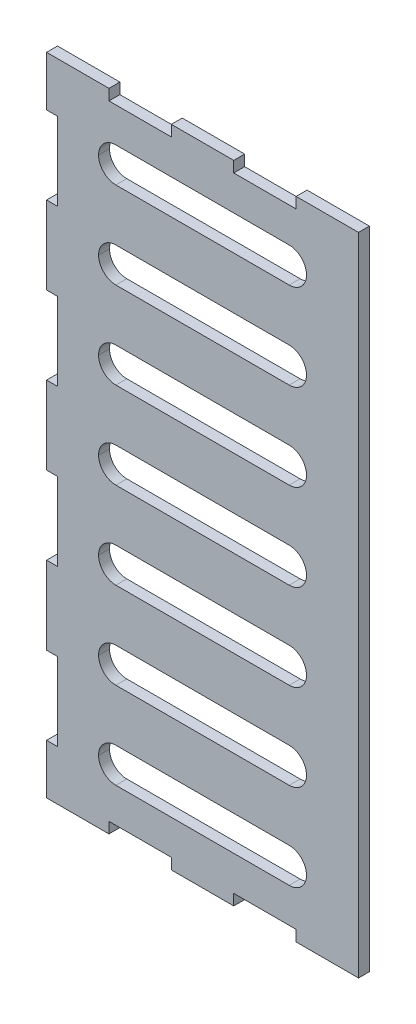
ISO-10303-21;
HEADER;
FILE_DESCRIPTION(('STEP AP214'),'2;1');
FILE_NAME('part.step','',(''),(''),'','','');
FILE_SCHEMA(('AUTOMOTIVE_DESIGN { 1 0 10303 214 1 1 1 1 }'));
ENDSEC;
DATA;
#1=APPLICATION_CONTEXT('core data for automotive mechanical design processes');
#2=APPLICATION_PROTOCOL_DEFINITION('international standard','automotive_design',2000,#1);
#3=PRODUCT_CONTEXT('',#1,'mechanical');
#4=PRODUCT('Part','Part','',(#3));
#5=PRODUCT_RELATED_PRODUCT_CATEGORY('part','',(#4));
#6=PRODUCT_DEFINITION_FORMATION('','',#4);
#7=PRODUCT_DEFINITION_CONTEXT('part definition',#1,'design');
#8=PRODUCT_DEFINITION('design','',#6,#7);
#9=PRODUCT_DEFINITION_SHAPE('','',#8);
#10=(LENGTH_UNIT() NAMED_UNIT(*) SI_UNIT(.MILLI.,.METRE.));
#11=(NAMED_UNIT(*) PLANE_ANGLE_UNIT() SI_UNIT($,.RADIAN.));
#12=(NAMED_UNIT(*) SI_UNIT($,.STERADIAN.) SOLID_ANGLE_UNIT());
#13=UNCERTAINTY_MEASURE_WITH_UNIT(LENGTH_MEASURE(1.E-05),#10,'distance_accuracy_value','');
#14=(GEOMETRIC_REPRESENTATION_CONTEXT(3) GLOBAL_UNCERTAINTY_ASSIGNED_CONTEXT((#13)) GLOBAL_UNIT_ASSIGNED_CONTEXT((#10,
#11,#12)) REPRESENTATION_CONTEXT('',''));
#15=CARTESIAN_POINT('',(0.,0.,0.));
#16=DIRECTION('',(0.,0.,1.));
#17=DIRECTION('',(1.,0.,0.));
#18=AXIS2_PLACEMENT_3D('',#15,#16,#17);
#19=CARTESIAN_POINT('',(0.,0.,16.));
#20=DIRECTION('',(0.,0.,-1.));
#21=DIRECTION('',(-1.,0.,0.));
#22=AXIS2_PLACEMENT_3D('',#19,#20,#21);
#23=PLANE('',#22);
#24=CARTESIAN_POINT('',(-230.141446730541,293.874365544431,16.));
#25=DIRECTION('',(0.,0.,-1.));
#26=DIRECTION('',(-1.,0.,0.));
#27=AXIS2_PLACEMENT_3D('',#24,#25,#26);
#28=CIRCLE('',#27,25.4);
#29=CARTESIAN_POINT('',(-230.141446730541,319.274365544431,16.));
#30=VERTEX_POINT('',#29);
#31=CARTESIAN_POINT('',(-204.741446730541,293.874365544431,16.));
#32=VERTEX_POINT('',#31);
#33=EDGE_CURVE('E682',#30,#32,#28,.T.);
#34=ORIENTED_EDGE('',*,*,#33,.T.);
#35=CARTESIAN_POINT('',(-230.141446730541,293.874365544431,16.));
#36=DIRECTION('',(0.,0.,-1.));
#37=DIRECTION('',(-1.,0.,0.));
#38=AXIS2_PLACEMENT_3D('',#35,#36,#37);
#39=CIRCLE('',#38,25.4);
#40=CARTESIAN_POINT('',(-230.141446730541,268.474365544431,16.));
#41=VERTEX_POINT('',#40);
#42=EDGE_CURVE('E709',#32,#41,#39,.T.);
#43=ORIENTED_EDGE('',*,*,#42,.T.);
#44=DIRECTION('',(1.,0.,0.));
#45=VECTOR('',#44,1.);
#46=CARTESIAN_POINT('',(-204.741446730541,268.474365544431,16.));
#47=LINE('',#46,#45);
#48=CARTESIAN_POINT('',(-484.141446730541,268.474365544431,16.));
#49=VERTEX_POINT('',#48);
#50=EDGE_CURVE('E1932',#49,#41,#47,.T.);
#51=ORIENTED_EDGE('',*,*,#50,.F.);
#52=CARTESIAN_POINT('',(-484.141446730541,293.874365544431,16.));
#53=DIRECTION('',(0.,0.,-1.));
#54=DIRECTION('',(-1.,0.,0.));
#55=AXIS2_PLACEMENT_3D('',#52,#53,#54);
#56=CIRCLE('',#55,25.4);
#57=CARTESIAN_POINT('',(-509.541446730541,293.874365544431,16.));
#58=VERTEX_POINT('',#57);
#59=EDGE_CURVE('E654',#49,#58,#56,.T.);
#60=ORIENTED_EDGE('',*,*,#59,.T.);
#61=CARTESIAN_POINT('',(-484.141446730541,293.874365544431,16.));
#62=DIRECTION('',(0.,0.,-1.));
#63=DIRECTION('',(-1.,0.,0.));
#64=AXIS2_PLACEMENT_3D('',#61,#62,#63);
#65=CIRCLE('',#64,25.4);
#66=CARTESIAN_POINT('',(-484.141446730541,319.274365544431,16.));
#67=VERTEX_POINT('',#66);
#68=EDGE_CURVE('E642',#58,#67,#65,.T.);
#69=ORIENTED_EDGE('',*,*,#68,.T.);
#70=DIRECTION('',(-1.,0.,0.));
#71=VECTOR('',#70,1.);
#72=CARTESIAN_POINT('',(-204.741446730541,319.274365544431,16.));
#73=LINE('',#72,#71);
#74=EDGE_CURVE('E1929',#30,#67,#73,.T.);
#75=ORIENTED_EDGE('',*,*,#74,.F.);
#76=EDGE_LOOP('',(#34,#43,#51,#60,#69,#75));
#77=FACE_BOUND('',#76,.T.);
#78=CARTESIAN_POINT('',(-230.14144673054,39.8743655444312,16.));
#79=DIRECTION('',(0.,0.,-1.));
#80=DIRECTION('',(-1.,0.,0.));
#81=AXIS2_PLACEMENT_3D('',#78,#79,#80);
#82=CIRCLE('',#81,25.4);
#83=CARTESIAN_POINT('',(-230.14144673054,65.2743655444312,16.));
#84=VERTEX_POINT('',#83);
#85=CARTESIAN_POINT('',(-204.74144673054,39.8743655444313,16.));
#86=VERTEX_POINT('',#85);
#87=EDGE_CURVE('E690',#84,#86,#82,.T.);
#88=ORIENTED_EDGE('',*,*,#87,.T.);
#89=CARTESIAN_POINT('',(-230.14144673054,39.8743655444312,16.));
#90=DIRECTION('',(0.,0.,-1.));
#91=DIRECTION('',(-1.,0.,0.));
#92=AXIS2_PLACEMENT_3D('',#89,#90,#91);
#93=CIRCLE('',#92,25.4);
#94=CARTESIAN_POINT('',(-230.14144673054,14.4743655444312,16.));
#95=VERTEX_POINT('',#94);
#96=EDGE_CURVE('E717',#86,#95,#93,.T.);
#97=ORIENTED_EDGE('',*,*,#96,.T.);
#98=DIRECTION('',(1.,0.,0.));
#99=VECTOR('',#98,1.);
#100=CARTESIAN_POINT('',(-204.74144673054,14.4743655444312,16.));
#101=LINE('',#100,#99);
#102=CARTESIAN_POINT('',(-484.14144673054,14.4743655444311,16.));
#103=VERTEX_POINT('',#102);
#104=EDGE_CURVE('E1864',#103,#95,#101,.T.);
#105=ORIENTED_EDGE('',*,*,#104,.F.);
#106=CARTESIAN_POINT('',(-484.14144673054,39.8743655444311,16.));
#107=DIRECTION('',(0.,0.,-1.));
#108=DIRECTION('',(-1.,0.,0.));
#109=AXIS2_PLACEMENT_3D('',#106,#107,#108);
#110=CIRCLE('',#109,25.4);
#111=CARTESIAN_POINT('',(-509.54144673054,39.8743655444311,16.));
#112=VERTEX_POINT('',#111);
#113=EDGE_CURVE('E662',#103,#112,#110,.T.);
#114=ORIENTED_EDGE('',*,*,#113,.T.);
#115=CARTESIAN_POINT('',(-484.14144673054,39.8743655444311,16.));
#116=DIRECTION('',(0.,0.,-1.));
#117=DIRECTION('',(-1.,0.,0.));
#118=AXIS2_PLACEMENT_3D('',#115,#116,#117);
#119=CIRCLE('',#118,25.4);
#120=CARTESIAN_POINT('',(-484.14144673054,65.2743655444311,16.));
#121=VERTEX_POINT('',#120);
#122=EDGE_CURVE('E634',#112,#121,#119,.T.);
#123=ORIENTED_EDGE('',*,*,#122,.T.);
#124=DIRECTION('',(-1.,0.,0.));
#125=VECTOR('',#124,1.);
#126=CARTESIAN_POINT('',(-204.74144673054,65.2743655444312,16.));
#127=LINE('',#126,#125);
#128=EDGE_CURVE('E1869',#84,#121,#127,.T.);
#129=ORIENTED_EDGE('',*,*,#128,.F.);
#130=EDGE_LOOP('',(#88,#97,#105,#114,#123,#129));
#131=FACE_BOUND('',#130,.T.);
#132=CARTESIAN_POINT('',(-230.141446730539,-214.125634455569,16.));
#133=DIRECTION('',(0.,0.,-1.));
#134=DIRECTION('',(-1.,0.,0.));
#135=AXIS2_PLACEMENT_3D('',#132,#133,#134);
#136=CIRCLE('',#135,25.4);
#137=CARTESIAN_POINT('',(-230.141446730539,-188.725634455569,16.));
#138=VERTEX_POINT('',#137);
#139=CARTESIAN_POINT('',(-204.741446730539,-214.125634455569,16.));
#140=VERTEX_POINT('',#139);
#141=EDGE_CURVE('E698',#138,#140,#136,.T.);
#142=ORIENTED_EDGE('',*,*,#141,.T.);
#143=CARTESIAN_POINT('',(-230.141446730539,-214.125634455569,16.));
#144=DIRECTION('',(0.,0.,-1.));
#145=DIRECTION('',(-1.,0.,0.));
#146=AXIS2_PLACEMENT_3D('',#143,#144,#145);
#147=CIRCLE('',#146,25.4);
#148=CARTESIAN_POINT('',(-230.141446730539,-239.525634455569,16.));
#149=VERTEX_POINT('',#148);
#150=EDGE_CURVE('E725',#140,#149,#147,.T.);
#151=ORIENTED_EDGE('',*,*,#150,.T.);
#152=DIRECTION('',(1.,0.,0.));
#153=VECTOR('',#152,1.);
#154=CARTESIAN_POINT('',(-204.741446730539,-239.525634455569,16.));
#155=LINE('',#154,#153);
#156=CARTESIAN_POINT('',(-484.141446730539,-239.525634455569,16.));
#157=VERTEX_POINT('',#156);
#158=EDGE_CURVE('E797',#157,#149,#155,.T.);
#159=ORIENTED_EDGE('',*,*,#158,.F.);
#160=CARTESIAN_POINT('',(-484.141446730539,-214.125634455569,16.));
#161=DIRECTION('',(0.,0.,-1.));
#162=DIRECTION('',(-1.,0.,0.));
#163=AXIS2_PLACEMENT_3D('',#160,#161,#162);
#164=CIRCLE('',#163,25.4);
#165=CARTESIAN_POINT('',(-509.541446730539,-214.125634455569,16.));
#166=VERTEX_POINT('',#165);
#167=EDGE_CURVE('E670',#157,#166,#164,.T.);
#168=ORIENTED_EDGE('',*,*,#167,.T.);
#169=CARTESIAN_POINT('',(-484.141446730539,-214.125634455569,16.));
#170=DIRECTION('',(0.,0.,-1.));
#171=DIRECTION('',(-1.,0.,0.));
#172=AXIS2_PLACEMENT_3D('',#169,#170,#171);
#173=CIRCLE('',#172,25.4);
#174=CARTESIAN_POINT('',(-484.141446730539,-188.725634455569,16.));
#175=VERTEX_POINT('',#174);
#176=EDGE_CURVE('E626',#166,#175,#173,.T.);
#177=ORIENTED_EDGE('',*,*,#176,.T.);
#178=DIRECTION('',(-1.,0.,0.));
#179=VECTOR('',#178,1.);
#180=CARTESIAN_POINT('',(-204.741446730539,-188.725634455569,16.));
#181=LINE('',#180,#179);
#182=EDGE_CURVE('E1838',#138,#175,#181,.T.);
#183=ORIENTED_EDGE('',*,*,#182,.F.);
#184=EDGE_LOOP('',(#142,#151,#159,#168,#177,#183));
#185=FACE_BOUND('',#184,.T.);
#186=DIRECTION('',(0.,1.,0.));
#187=VECTOR('',#186,1.);
#188=CARTESIAN_POINT('',(-494.301446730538,497.074365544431,16.));
#189=LINE('',#188,#187);
#190=CARTESIAN_POINT('',(-494.301446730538,497.074365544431,16.));
#191=VERTEX_POINT('',#190);
#192=CARTESIAN_POINT('',(-494.301446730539,513.074365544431,16.));
#193=VERTEX_POINT('',#192);
#194=EDGE_CURVE('E532',#191,#193,#189,.T.);
#195=ORIENTED_EDGE('',*,*,#194,.T.);
#196=DIRECTION('',(-1.,0.,0.));
#197=VECTOR('',#196,1.);
#198=CARTESIAN_POINT('',(-585.741446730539,513.074365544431,16.));
#199=LINE('',#198,#197);
#200=CARTESIAN_POINT('',(-585.741446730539,513.074365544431,16.));
#201=VERTEX_POINT('',#200);
#202=EDGE_CURVE('E521',#193,#201,#199,.T.);
#203=ORIENTED_EDGE('',*,*,#202,.T.);
#204=DIRECTION('',(0.,-1.,0.));
#205=VECTOR('',#204,1.);
#206=CARTESIAN_POINT('',(-585.741446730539,439.922365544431,16.));
#207=LINE('',#206,#205);
#208=CARTESIAN_POINT('',(-585.741446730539,439.922365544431,16.));
#209=VERTEX_POINT('',#208);
#210=EDGE_CURVE('E531',#201,#209,#207,.T.);
#211=ORIENTED_EDGE('',*,*,#210,.T.);
#212=DIRECTION('',(1.,0.,0.));
#213=VECTOR('',#212,1.);
#214=CARTESIAN_POINT('',(-585.741446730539,439.922365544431,16.));
#215=LINE('',#214,#213);
#216=CARTESIAN_POINT('',(-569.741446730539,439.922365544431,16.));
#217=VERTEX_POINT('',#216);
#218=EDGE_CURVE('E800',#209,#217,#215,.T.);
#219=ORIENTED_EDGE('',*,*,#218,.T.);
#220=DIRECTION('',(0.,-1.,0.));
#221=VECTOR('',#220,1.);
#222=CARTESIAN_POINT('',(-569.741446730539,439.922365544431,16.));
#223=LINE('',#222,#221);
#224=CARTESIAN_POINT('',(-569.741446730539,325.622365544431,16.));
#225=VERTEX_POINT('',#224);
#226=EDGE_CURVE('E802',#217,#225,#223,.T.);
#227=ORIENTED_EDGE('',*,*,#226,.T.);
#228=DIRECTION('',(-1.,0.,0.));
#229=VECTOR('',#228,1.);
#230=CARTESIAN_POINT('',(-585.741446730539,325.622365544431,16.));
#231=LINE('',#230,#229);
#232=CARTESIAN_POINT('',(-585.741446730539,325.622365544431,16.));
#233=VERTEX_POINT('',#232);
#234=EDGE_CURVE('E804',#225,#233,#231,.T.);
#235=ORIENTED_EDGE('',*,*,#234,.T.);
#236=DIRECTION('',(0.,-1.,0.));
#237=VECTOR('',#236,1.);
#238=CARTESIAN_POINT('',(-585.741446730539,325.622365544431,16.));
#239=LINE('',#238,#237);
#240=CARTESIAN_POINT('',(-585.741446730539,211.323698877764,16.));
#241=VERTEX_POINT('',#240);
#242=EDGE_CURVE('E806',#233,#241,#239,.T.);
#243=ORIENTED_EDGE('',*,*,#242,.T.);
#244=DIRECTION('',(1.,0.,0.));
#245=VECTOR('',#244,1.);
#246=CARTESIAN_POINT('',(-585.741446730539,211.323698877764,16.));
#247=LINE('',#246,#245);
#248=CARTESIAN_POINT('',(-569.741446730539,211.323698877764,16.));
#249=VERTEX_POINT('',#248);
#250=EDGE_CURVE('E808',#241,#249,#247,.T.);
#251=ORIENTED_EDGE('',*,*,#250,.T.);
#252=DIRECTION('',(0.,-1.,0.));
#253=VECTOR('',#252,1.);
#254=CARTESIAN_POINT('',(-569.741446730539,211.323698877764,16.));
#255=LINE('',#254,#253);
#256=CARTESIAN_POINT('',(-569.741446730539,97.0236988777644,16.));
#257=VERTEX_POINT('',#256);
#258=EDGE_CURVE('E810',#249,#257,#255,.T.);
#259=ORIENTED_EDGE('',*,*,#258,.T.);
#260=DIRECTION('',(-1.,0.,0.));
#261=VECTOR('',#260,1.);
#262=CARTESIAN_POINT('',(-585.741446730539,97.0236988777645,16.));
#263=LINE('',#262,#261);
#264=CARTESIAN_POINT('',(-585.741446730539,97.0236988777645,16.));
#265=VERTEX_POINT('',#264);
#266=EDGE_CURVE('E812',#257,#265,#263,.T.);
#267=ORIENTED_EDGE('',*,*,#266,.T.);
#268=DIRECTION('',(0.,-1.,0.));
#269=VECTOR('',#268,1.);
#270=CARTESIAN_POINT('',(-585.741446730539,-17.2749677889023,16.));
#271=LINE('',#270,#269);
#272=CARTESIAN_POINT('',(-585.741446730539,-17.2749677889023,16.));
#273=VERTEX_POINT('',#272);
#274=EDGE_CURVE('E814',#265,#273,#271,.T.);
#275=ORIENTED_EDGE('',*,*,#274,.T.);
#276=DIRECTION('',(1.,0.,0.));
#277=VECTOR('',#276,1.);
#278=CARTESIAN_POINT('',(-585.741446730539,-17.2749677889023,16.));
#279=LINE('',#278,#277);
#280=CARTESIAN_POINT('',(-569.741446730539,-17.2749677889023,16.));
#281=VERTEX_POINT('',#280);
#282=EDGE_CURVE('E816',#273,#281,#279,.T.);
#283=ORIENTED_EDGE('',*,*,#282,.T.);
#284=DIRECTION('',(0.,-1.,0.));
#285=VECTOR('',#284,1.);
#286=CARTESIAN_POINT('',(-569.741446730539,-17.2749677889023,16.));
#287=LINE('',#286,#285);
#288=CARTESIAN_POINT('',(-569.741446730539,-131.574967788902,16.));
#289=VERTEX_POINT('',#288);
#290=EDGE_CURVE('E818',#281,#289,#287,.T.);
#291=ORIENTED_EDGE('',*,*,#290,.T.);
#292=DIRECTION('',(-1.,0.,0.));
#293=VECTOR('',#292,1.);
#294=CARTESIAN_POINT('',(-585.741446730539,-131.574967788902,16.));
#295=LINE('',#294,#293);
#296=CARTESIAN_POINT('',(-585.741446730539,-131.574967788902,16.));
#297=VERTEX_POINT('',#296);
#298=EDGE_CURVE('E820',#289,#297,#295,.T.);
#299=ORIENTED_EDGE('',*,*,#298,.T.);
#300=DIRECTION('',(0.,-1.,0.));
#301=VECTOR('',#300,1.);
#302=CARTESIAN_POINT('',(-585.741446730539,-245.873634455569,16.));
#303=LINE('',#302,#301);
#304=CARTESIAN_POINT('',(-585.741446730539,-245.873634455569,16.));
#305=VERTEX_POINT('',#304);
#306=EDGE_CURVE('E822',#297,#305,#303,.T.);
#307=ORIENTED_EDGE('',*,*,#306,.T.);
#308=DIRECTION('',(1.,0.,0.));
#309=VECTOR('',#308,1.);
#310=CARTESIAN_POINT('',(-585.741446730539,-245.873634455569,16.));
#311=LINE('',#310,#309);
#312=CARTESIAN_POINT('',(-569.741446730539,-245.873634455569,16.));
#313=VERTEX_POINT('',#312);
#314=EDGE_CURVE('E824',#305,#313,#311,.T.);
#315=ORIENTED_EDGE('',*,*,#314,.T.);
#316=DIRECTION('',(0.,-1.,0.));
#317=VECTOR('',#316,1.);
#318=CARTESIAN_POINT('',(-569.741446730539,-245.873634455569,16.));
#319=LINE('',#318,#317);
#320=CARTESIAN_POINT('',(-569.741446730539,-360.173634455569,16.));
#321=VERTEX_POINT('',#320);
#322=EDGE_CURVE('E826',#313,#321,#319,.T.);
#323=ORIENTED_EDGE('',*,*,#322,.T.);
#324=DIRECTION('',(-1.,0.,0.));
#325=VECTOR('',#324,1.);
#326=CARTESIAN_POINT('',(-585.741446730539,-360.173634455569,16.));
#327=LINE('',#326,#325);
#328=CARTESIAN_POINT('',(-585.741446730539,-360.173634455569,16.));
#329=VERTEX_POINT('',#328);
#330=EDGE_CURVE('E828',#321,#329,#327,.T.);
#331=ORIENTED_EDGE('',*,*,#330,.T.);
#332=DIRECTION('',(0.,-1.,0.));
#333=VECTOR('',#332,1.);
#334=CARTESIAN_POINT('',(-585.741446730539,-433.325634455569,16.));
#335=LINE('',#334,#333);
#336=CARTESIAN_POINT('',(-585.741446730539,-433.325634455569,16.));
#337=VERTEX_POINT('',#336);
#338=EDGE_CURVE('E830',#329,#337,#335,.T.);
#339=ORIENTED_EDGE('',*,*,#338,.T.);
#340=DIRECTION('',(1.,0.,0.));
#341=VECTOR('',#340,1.);
#342=CARTESIAN_POINT('',(-585.741446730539,-433.325634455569,16.));
#343=LINE('',#342,#341);
#344=CARTESIAN_POINT('',(-494.301446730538,-433.325634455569,16.));
#345=VERTEX_POINT('',#344);
#346=EDGE_CURVE('E832',#337,#345,#343,.T.);
#347=ORIENTED_EDGE('',*,*,#346,.T.);
#348=DIRECTION('',(0.,1.,0.));
#349=VECTOR('',#348,1.);
#350=CARTESIAN_POINT('',(-494.301446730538,-417.325634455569,16.));
#351=LINE('',#350,#349);
#352=CARTESIAN_POINT('',(-494.301446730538,-417.325634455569,16.));
#353=VERTEX_POINT('',#352);
#354=EDGE_CURVE('E834',#345,#353,#351,.T.);
#355=ORIENTED_EDGE('',*,*,#354,.T.);
#356=DIRECTION('',(1.,0.,0.));
#357=VECTOR('',#356,1.);
#358=CARTESIAN_POINT('',(-494.301446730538,-417.325634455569,16.));
#359=LINE('',#358,#357);
#360=CARTESIAN_POINT('',(-402.861446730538,-417.325634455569,16.));
#361=VERTEX_POINT('',#360);
#362=EDGE_CURVE('E836',#353,#361,#359,.T.);
#363=ORIENTED_EDGE('',*,*,#362,.T.);
#364=DIRECTION('',(0.,-1.,0.));
#365=VECTOR('',#364,1.);
#366=CARTESIAN_POINT('',(-402.861446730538,-417.325634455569,16.));
#367=LINE('',#366,#365);
#368=CARTESIAN_POINT('',(-402.861446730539,-433.325634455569,16.));
#369=VERTEX_POINT('',#368);
#370=EDGE_CURVE('E838',#361,#369,#367,.T.);
#371=ORIENTED_EDGE('',*,*,#370,.T.);
#372=DIRECTION('',(1.,0.,0.));
#373=VECTOR('',#372,1.);
#374=CARTESIAN_POINT('',(-402.861446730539,-433.325634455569,16.));
#375=LINE('',#374,#373);
#376=CARTESIAN_POINT('',(-311.421446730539,-433.325634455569,16.));
#377=VERTEX_POINT('',#376);
#378=EDGE_CURVE('E840',#369,#377,#375,.T.);
#379=ORIENTED_EDGE('',*,*,#378,.T.);
#380=DIRECTION('',(0.,1.,0.));
#381=VECTOR('',#380,1.);
#382=CARTESIAN_POINT('',(-311.421446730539,-417.325634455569,16.));
#383=LINE('',#382,#381);
#384=CARTESIAN_POINT('',(-311.421446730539,-417.325634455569,16.));
#385=VERTEX_POINT('',#384);
#386=EDGE_CURVE('E842',#377,#385,#383,.T.);
#387=ORIENTED_EDGE('',*,*,#386,.T.);
#388=DIRECTION('',(1.,0.,0.));
#389=VECTOR('',#388,1.);
#390=CARTESIAN_POINT('',(-311.421446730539,-417.325634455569,16.));
#391=LINE('',#390,#389);
#392=CARTESIAN_POINT('',(-219.981446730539,-417.325634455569,16.));
#393=VERTEX_POINT('',#392);
#394=EDGE_CURVE('E844',#385,#393,#391,.T.);
#395=ORIENTED_EDGE('',*,*,#394,.T.);
#396=DIRECTION('',(0.,-1.,0.));
#397=VECTOR('',#396,1.);
#398=CARTESIAN_POINT('',(-219.981446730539,-417.325634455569,16.));
#399=LINE('',#398,#397);
#400=CARTESIAN_POINT('',(-219.981446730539,-433.325634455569,16.));
#401=VERTEX_POINT('',#400);
#402=EDGE_CURVE('E846',#393,#401,#399,.T.);
#403=ORIENTED_EDGE('',*,*,#402,.T.);
#404=DIRECTION('',(1.,0.,0.));
#405=VECTOR('',#404,1.);
#406=CARTESIAN_POINT('',(-219.981446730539,-433.325634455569,16.));
#407=LINE('',#406,#405);
#408=CARTESIAN_POINT('',(-128.541446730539,-433.325634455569,16.));
#409=VERTEX_POINT('',#408);
#410=EDGE_CURVE('E848',#401,#409,#407,.T.);
#411=ORIENTED_EDGE('',*,*,#410,.T.);
#412=DIRECTION('',(0.,1.,0.));
#413=VECTOR('',#412,1.);
#414=CARTESIAN_POINT('',(-128.541446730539,513.074365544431,16.));
#415=LINE('',#414,#413);
#416=CARTESIAN_POINT('',(-128.541446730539,513.074365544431,16.));
#417=VERTEX_POINT('',#416);
#418=EDGE_CURVE('E850',#409,#417,#415,.T.);
#419=ORIENTED_EDGE('',*,*,#418,.T.);
#420=DIRECTION('',(-1.,0.,0.));
#421=VECTOR('',#420,1.);
#422=CARTESIAN_POINT('',(-219.981446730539,513.074365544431,16.));
#423=LINE('',#422,#421);
#424=CARTESIAN_POINT('',(-219.981446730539,513.074365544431,16.));
#425=VERTEX_POINT('',#424);
#426=EDGE_CURVE('E852',#417,#425,#423,.T.);
#427=ORIENTED_EDGE('',*,*,#426,.T.);
#428=DIRECTION('',(0.,-1.,0.));
#429=VECTOR('',#428,1.);
#430=CARTESIAN_POINT('',(-219.981446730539,497.074365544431,16.));
#431=LINE('',#430,#429);
#432=CARTESIAN_POINT('',(-219.981446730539,497.074365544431,16.));
#433=VERTEX_POINT('',#432);
#434=EDGE_CURVE('E854',#425,#433,#431,.T.);
#435=ORIENTED_EDGE('',*,*,#434,.T.);
#436=DIRECTION('',(-1.,0.,0.));
#437=VECTOR('',#436,1.);
#438=CARTESIAN_POINT('',(-311.421446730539,497.074365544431,16.));
#439=LINE('',#438,#437);
#440=CARTESIAN_POINT('',(-311.421446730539,497.074365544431,16.));
#441=VERTEX_POINT('',#440);
#442=EDGE_CURVE('E856',#433,#441,#439,.T.);
#443=ORIENTED_EDGE('',*,*,#442,.T.);
#444=DIRECTION('',(0.,1.,0.));
#445=VECTOR('',#444,1.);
#446=CARTESIAN_POINT('',(-311.421446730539,497.074365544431,16.));
#447=LINE('',#446,#445);
#448=CARTESIAN_POINT('',(-311.421446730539,513.074365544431,16.));
#449=VERTEX_POINT('',#448);
#450=EDGE_CURVE('E858',#441,#449,#447,.T.);
#451=ORIENTED_EDGE('',*,*,#450,.T.);
#452=DIRECTION('',(-1.,0.,0.));
#453=VECTOR('',#452,1.);
#454=CARTESIAN_POINT('',(-402.861446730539,513.074365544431,16.));
#455=LINE('',#454,#453);
#456=CARTESIAN_POINT('',(-402.861446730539,513.074365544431,16.));
#457=VERTEX_POINT('',#456);
#458=EDGE_CURVE('E860',#449,#457,#455,.T.);
#459=ORIENTED_EDGE('',*,*,#458,.T.);
#460=DIRECTION('',(0.,-1.,0.));
#461=VECTOR('',#460,1.);
#462=CARTESIAN_POINT('',(-402.861446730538,497.074365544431,16.));
#463=LINE('',#462,#461);
#464=CARTESIAN_POINT('',(-402.861446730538,497.074365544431,16.));
#465=VERTEX_POINT('',#464);
#466=EDGE_CURVE('E862',#457,#465,#463,.T.);
#467=ORIENTED_EDGE('',*,*,#466,.T.);
#468=DIRECTION('',(-1.,0.,0.));
#469=VECTOR('',#468,1.);
#470=CARTESIAN_POINT('',(-494.301446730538,497.074365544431,16.));
#471=LINE('',#470,#469);
#472=EDGE_CURVE('E536',#465,#191,#471,.T.);
#473=ORIENTED_EDGE('',*,*,#472,.T.);
#474=EDGE_LOOP('',(#195,#203,#211,#219,#227,#235,#243,#251,#259,#267,#275,#283,#291,#299,#307,
#315,#323,#331,#339,#347,#355,#363,#371,#379,#387,#395,#403,#411,#419,#427,#435,#443,#451,#459,
#467,#473));
#475=FACE_BOUND('',#474,.T.);
#476=CARTESIAN_POINT('',(-230.141446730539,-341.125634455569,16.));
#477=DIRECTION('',(0.,0.,-1.));
#478=DIRECTION('',(-1.,0.,0.));
#479=AXIS2_PLACEMENT_3D('',#476,#477,#478);
#480=CIRCLE('',#479,25.4);
#481=CARTESIAN_POINT('',(-230.141446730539,-315.725634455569,16.));
#482=VERTEX_POINT('',#481);
#483=CARTESIAN_POINT('',(-204.741446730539,-341.125634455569,16.));
#484=VERTEX_POINT('',#483);
#485=EDGE_CURVE('E51',#482,#484,#480,.T.);
#486=ORIENTED_EDGE('',*,*,#485,.T.);
#487=CARTESIAN_POINT('',(-230.141446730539,-341.125634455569,16.));
#488=DIRECTION('',(0.,0.,-1.));
#489=DIRECTION('',(-1.,0.,0.));
#490=AXIS2_PLACEMENT_3D('',#487,#488,#489);
#491=CIRCLE('',#490,25.4);
#492=CARTESIAN_POINT('',(-230.141446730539,-366.525634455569,16.));
#493=VERTEX_POINT('',#492);
#494=EDGE_CURVE('E11',#484,#493,#491,.T.);
#495=ORIENTED_EDGE('',*,*,#494,.T.);
#496=DIRECTION('',(1.,0.,0.));
#497=VECTOR('',#496,1.);
#498=CARTESIAN_POINT('',(-204.741446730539,-366.525634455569,16.));
#499=LINE('',#498,#497);
#500=CARTESIAN_POINT('',(-484.141446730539,-366.525634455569,16.));
#501=VERTEX_POINT('',#500);
#502=EDGE_CURVE('E779',#501,#493,#499,.T.);
#503=ORIENTED_EDGE('',*,*,#502,.F.);
#504=CARTESIAN_POINT('',(-484.141446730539,-341.125634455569,16.));
#505=DIRECTION('',(0.,0.,-1.));
#506=DIRECTION('',(-1.,0.,0.));
#507=AXIS2_PLACEMENT_3D('',#504,#505,#506);
#508=CIRCLE('',#507,25.4);
#509=CARTESIAN_POINT('',(-509.541446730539,-341.125634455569,16.));
#510=VERTEX_POINT('',#509);
#511=EDGE_CURVE('E674',#501,#510,#508,.T.);
#512=ORIENTED_EDGE('',*,*,#511,.T.);
#513=CARTESIAN_POINT('',(-484.141446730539,-341.125634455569,16.));
#514=DIRECTION('',(0.,0.,-1.));
#515=DIRECTION('',(-1.,0.,0.));
#516=AXIS2_PLACEMENT_3D('',#513,#514,#515);
#517=CIRCLE('',#516,25.4);
#518=CARTESIAN_POINT('',(-484.141446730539,-315.725634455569,16.));
#519=VERTEX_POINT('',#518);
#520=EDGE_CURVE('E622',#510,#519,#517,.T.);
#521=ORIENTED_EDGE('',*,*,#520,.T.);
#522=DIRECTION('',(-1.,0.,0.));
#523=VECTOR('',#522,1.);
#524=CARTESIAN_POINT('',(-204.741446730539,-315.725634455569,16.));
#525=LINE('',#524,#523);
#526=EDGE_CURVE('E785',#482,#519,#525,.T.);
#527=ORIENTED_EDGE('',*,*,#526,.F.);
#528=EDGE_LOOP('',(#486,#495,#503,#512,#521,#527));
#529=FACE_BOUND('',#528,.T.);
#530=CARTESIAN_POINT('',(-230.14144673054,-87.1256344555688,16.));
#531=DIRECTION('',(0.,0.,-1.));
#532=DIRECTION('',(-1.,0.,0.));
#533=AXIS2_PLACEMENT_3D('',#530,#531,#532);
#534=CIRCLE('',#533,25.4);
#535=CARTESIAN_POINT('',(-230.14144673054,-61.7256344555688,16.));
#536=VERTEX_POINT('',#535);
#537=CARTESIAN_POINT('',(-204.74144673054,-87.1256344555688,16.));
#538=VERTEX_POINT('',#537);
#539=EDGE_CURVE('E694',#536,#538,#534,.T.);
#540=ORIENTED_EDGE('',*,*,#539,.T.);
#541=CARTESIAN_POINT('',(-230.14144673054,-87.1256344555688,16.));
#542=DIRECTION('',(0.,0.,-1.));
#543=DIRECTION('',(-1.,0.,0.));
#544=AXIS2_PLACEMENT_3D('',#541,#542,#543);
#545=CIRCLE('',#544,25.4);
#546=CARTESIAN_POINT('',(-230.14144673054,-112.525634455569,16.));
#547=VERTEX_POINT('',#546);
#548=EDGE_CURVE('E721',#538,#547,#545,.T.);
#549=ORIENTED_EDGE('',*,*,#548,.T.);
#550=DIRECTION('',(1.,0.,0.));
#551=VECTOR('',#550,1.);
#552=CARTESIAN_POINT('',(-204.741446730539,-112.525634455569,16.));
#553=LINE('',#552,#551);
#554=CARTESIAN_POINT('',(-484.141446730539,-112.525634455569,16.));
#555=VERTEX_POINT('',#554);
#556=EDGE_CURVE('E1852',#555,#547,#553,.T.);
#557=ORIENTED_EDGE('',*,*,#556,.F.);
#558=CARTESIAN_POINT('',(-484.141446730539,-87.1256344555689,16.));
#559=DIRECTION('',(0.,0.,-1.));
#560=DIRECTION('',(-1.,0.,0.));
#561=AXIS2_PLACEMENT_3D('',#558,#559,#560);
#562=CIRCLE('',#561,25.4);
#563=CARTESIAN_POINT('',(-509.541446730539,-87.1256344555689,16.));
#564=VERTEX_POINT('',#563);
#565=EDGE_CURVE('E666',#555,#564,#562,.T.);
#566=ORIENTED_EDGE('',*,*,#565,.T.);
#567=CARTESIAN_POINT('',(-484.141446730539,-87.1256344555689,16.));
#568=DIRECTION('',(0.,0.,-1.));
#569=DIRECTION('',(-1.,0.,0.));
#570=AXIS2_PLACEMENT_3D('',#567,#568,#569);
#571=CIRCLE('',#570,25.4);
#572=CARTESIAN_POINT('',(-484.141446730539,-61.7256344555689,16.));
#573=VERTEX_POINT('',#572);
#574=EDGE_CURVE('E630',#564,#573,#571,.T.);
#575=ORIENTED_EDGE('',*,*,#574,.T.);
#576=DIRECTION('',(-1.,0.,0.));
#577=VECTOR('',#576,1.);
#578=CARTESIAN_POINT('',(-204.74144673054,-61.7256344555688,16.));
#579=LINE('',#578,#577);
#580=EDGE_CURVE('E1855',#536,#573,#579,.T.);
#581=ORIENTED_EDGE('',*,*,#580,.F.);
#582=EDGE_LOOP('',(#540,#549,#557,#566,#575,#581));
#583=FACE_BOUND('',#582,.T.);
#584=CARTESIAN_POINT('',(-230.14144673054,166.874365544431,16.));
#585=DIRECTION('',(0.,0.,-1.));
#586=DIRECTION('',(-1.,0.,0.));
#587=AXIS2_PLACEMENT_3D('',#584,#585,#586);
#588=CIRCLE('',#587,25.4);
#589=CARTESIAN_POINT('',(-230.14144673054,192.274365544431,16.));
#590=VERTEX_POINT('',#589);
#591=CARTESIAN_POINT('',(-204.74144673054,166.874365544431,16.));
#592=VERTEX_POINT('',#591);
#593=EDGE_CURVE('E686',#590,#592,#588,.T.);
#594=ORIENTED_EDGE('',*,*,#593,.T.);
#595=CARTESIAN_POINT('',(-230.14144673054,166.874365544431,16.));
#596=DIRECTION('',(0.,0.,-1.));
#597=DIRECTION('',(-1.,0.,0.));
#598=AXIS2_PLACEMENT_3D('',#595,#596,#597);
#599=CIRCLE('',#598,25.4);
#600=CARTESIAN_POINT('',(-230.14144673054,141.474365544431,16.));
#601=VERTEX_POINT('',#600);
#602=EDGE_CURVE('E713',#592,#601,#599,.T.);
#603=ORIENTED_EDGE('',*,*,#602,.T.);
#604=DIRECTION('',(1.,0.,0.));
#605=VECTOR('',#604,1.);
#606=CARTESIAN_POINT('',(-204.74144673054,141.474365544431,16.));
#607=LINE('',#606,#605);
#608=CARTESIAN_POINT('',(-484.14144673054,141.474365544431,16.));
#609=VERTEX_POINT('',#608);
#610=EDGE_CURVE('E1880',#609,#601,#607,.T.);
#611=ORIENTED_EDGE('',*,*,#610,.F.);
#612=CARTESIAN_POINT('',(-484.14144673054,166.874365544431,16.));
#613=DIRECTION('',(0.,0.,-1.));
#614=DIRECTION('',(-1.,0.,0.));
#615=AXIS2_PLACEMENT_3D('',#612,#613,#614);
#616=CIRCLE('',#615,25.4);
#617=CARTESIAN_POINT('',(-509.54144673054,166.874365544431,16.));
#618=VERTEX_POINT('',#617);
#619=EDGE_CURVE('E658',#609,#618,#616,.T.);
#620=ORIENTED_EDGE('',*,*,#619,.T.);
#621=CARTESIAN_POINT('',(-484.14144673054,166.874365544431,16.));
#622=DIRECTION('',(0.,0.,-1.));
#623=DIRECTION('',(-1.,0.,0.));
#624=AXIS2_PLACEMENT_3D('',#621,#622,#623);
#625=CIRCLE('',#624,25.4);
#626=CARTESIAN_POINT('',(-484.14144673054,192.274365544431,16.));
#627=VERTEX_POINT('',#626);
#628=EDGE_CURVE('E638',#618,#627,#625,.T.);
#629=ORIENTED_EDGE('',*,*,#628,.T.);
#630=DIRECTION('',(-1.,0.,0.));
#631=VECTOR('',#630,1.);
#632=CARTESIAN_POINT('',(-204.74144673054,192.274365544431,16.));
#633=LINE('',#632,#631);
#634=EDGE_CURVE('E1940',#590,#627,#633,.T.);
#635=ORIENTED_EDGE('',*,*,#634,.F.);
#636=EDGE_LOOP('',(#594,#603,#611,#620,#629,#635));
#637=FACE_BOUND('',#636,.T.);
#638=CARTESIAN_POINT('',(-230.141446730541,420.874365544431,16.));
#639=DIRECTION('',(0.,0.,-1.));
#640=DIRECTION('',(-1.,0.,0.));
#641=AXIS2_PLACEMENT_3D('',#638,#639,#640);
#642=CIRCLE('',#641,25.4);
#643=CARTESIAN_POINT('',(-230.141446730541,446.274365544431,16.));
#644=VERTEX_POINT('',#643);
#645=CARTESIAN_POINT('',(-204.741446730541,420.874365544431,16.));
#646=VERTEX_POINT('',#645);
#647=EDGE_CURVE('E678',#644,#646,#642,.T.);
#648=ORIENTED_EDGE('',*,*,#647,.T.);
#649=CARTESIAN_POINT('',(-230.141446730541,420.874365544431,16.));
#650=DIRECTION('',(0.,0.,-1.));
#651=DIRECTION('',(-1.,0.,0.));
#652=AXIS2_PLACEMENT_3D('',#649,#650,#651);
#653=CIRCLE('',#652,25.4);
#654=CARTESIAN_POINT('',(-230.141446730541,395.474365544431,16.));
#655=VERTEX_POINT('',#654);
#656=EDGE_CURVE('E705',#646,#655,#653,.T.);
#657=ORIENTED_EDGE('',*,*,#656,.T.);
#658=DIRECTION('',(1.,0.,0.));
#659=VECTOR('',#658,1.);
#660=CARTESIAN_POINT('',(-204.741446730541,395.474365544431,16.));
#661=LINE('',#660,#659);
#662=CARTESIAN_POINT('',(-484.141446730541,395.474365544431,16.));
#663=VERTEX_POINT('',#662);
#664=EDGE_CURVE('E1920',#663,#655,#661,.T.);
#665=ORIENTED_EDGE('',*,*,#664,.F.);
#666=CARTESIAN_POINT('',(-484.141446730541,420.874365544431,16.));
#667=DIRECTION('',(0.,0.,-1.));
#668=DIRECTION('',(-1.,0.,0.));
#669=AXIS2_PLACEMENT_3D('',#666,#667,#668);
#670=CIRCLE('',#669,25.4);
#671=CARTESIAN_POINT('',(-509.541446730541,420.874365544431,16.));
#672=VERTEX_POINT('',#671);
#673=EDGE_CURVE('E650',#663,#672,#670,.T.);
#674=ORIENTED_EDGE('',*,*,#673,.T.);
#675=CARTESIAN_POINT('',(-484.141446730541,420.874365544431,16.));
#676=DIRECTION('',(0.,0.,-1.));
#677=DIRECTION('',(-1.,0.,0.));
#678=AXIS2_PLACEMENT_3D('',#675,#676,#677);
#679=CIRCLE('',#678,25.4);
#680=CARTESIAN_POINT('',(-484.141446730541,446.274365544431,16.));
#681=VERTEX_POINT('',#680);
#682=EDGE_CURVE('E646',#672,#681,#679,.T.);
#683=ORIENTED_EDGE('',*,*,#682,.T.);
#684=DIRECTION('',(-1.,0.,0.));
#685=VECTOR('',#684,1.);
#686=CARTESIAN_POINT('',(-204.741446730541,446.274365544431,16.));
#687=LINE('',#686,#685);
#688=EDGE_CURVE('E1917',#644,#681,#687,.T.);
#689=ORIENTED_EDGE('',*,*,#688,.F.);
#690=EDGE_LOOP('',(#648,#657,#665,#674,#683,#689));
#691=FACE_BOUND('',#690,.T.);
#692=ADVANCED_FACE('F35',(#77,#131,#185,#475,#529,#583,#637,#691),#23,.F.);
#693=CARTESIAN_POINT('',(0.,0.,0.));
#694=DIRECTION('',(0.,0.,-1.));
#695=DIRECTION('',(-1.,0.,0.));
#696=AXIS2_PLACEMENT_3D('',#693,#694,#695);
#697=PLANE('',#696);
#698=DIRECTION('',(0.,1.,0.));
#699=VECTOR('',#698,1.);
#700=CARTESIAN_POINT('',(-494.301446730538,497.074365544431,0.));
#701=LINE('',#700,#699);
#702=CARTESIAN_POINT('',(-494.301446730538,497.074365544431,0.));
#703=VERTEX_POINT('',#702);
#704=CARTESIAN_POINT('',(-494.301446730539,513.074365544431,0.));
#705=VERTEX_POINT('',#704);
#706=EDGE_CURVE('E544',#703,#705,#701,.T.);
#707=ORIENTED_EDGE('',*,*,#706,.F.);
#708=DIRECTION('',(-1.,0.,0.));
#709=VECTOR('',#708,1.);
#710=CARTESIAN_POINT('',(-494.301446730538,497.074365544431,0.));
#711=LINE('',#710,#709);
#712=CARTESIAN_POINT('',(-402.861446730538,497.074365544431,0.));
#713=VERTEX_POINT('',#712);
#714=EDGE_CURVE('E540',#713,#703,#711,.T.);
#715=ORIENTED_EDGE('',*,*,#714,.F.);
#716=DIRECTION('',(0.,-1.,0.));
#717=VECTOR('',#716,1.);
#718=CARTESIAN_POINT('',(-402.861446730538,497.074365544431,0.));
#719=LINE('',#718,#717);
#720=CARTESIAN_POINT('',(-402.861446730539,513.074365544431,0.));
#721=VERTEX_POINT('',#720);
#722=EDGE_CURVE('E931',#721,#713,#719,.T.);
#723=ORIENTED_EDGE('',*,*,#722,.F.);
#724=DIRECTION('',(-1.,0.,0.));
#725=VECTOR('',#724,1.);
#726=CARTESIAN_POINT('',(-402.861446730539,513.074365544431,0.));
#727=LINE('',#726,#725);
#728=CARTESIAN_POINT('',(-311.421446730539,513.074365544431,0.));
#729=VERTEX_POINT('',#728);
#730=EDGE_CURVE('E929',#729,#721,#727,.T.);
#731=ORIENTED_EDGE('',*,*,#730,.F.);
#732=DIRECTION('',(0.,1.,0.));
#733=VECTOR('',#732,1.);
#734=CARTESIAN_POINT('',(-311.421446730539,497.074365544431,0.));
#735=LINE('',#734,#733);
#736=CARTESIAN_POINT('',(-311.421446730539,497.074365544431,0.));
#737=VERTEX_POINT('',#736);
#738=EDGE_CURVE('E927',#737,#729,#735,.T.);
#739=ORIENTED_EDGE('',*,*,#738,.F.);
#740=DIRECTION('',(-1.,0.,0.));
#741=VECTOR('',#740,1.);
#742=CARTESIAN_POINT('',(-311.421446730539,497.074365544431,0.));
#743=LINE('',#742,#741);
#744=CARTESIAN_POINT('',(-219.981446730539,497.074365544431,0.));
#745=VERTEX_POINT('',#744);
#746=EDGE_CURVE('E925',#745,#737,#743,.T.);
#747=ORIENTED_EDGE('',*,*,#746,.F.);
#748=DIRECTION('',(0.,-1.,0.));
#749=VECTOR('',#748,1.);
#750=CARTESIAN_POINT('',(-219.981446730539,497.074365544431,0.));
#751=LINE('',#750,#749);
#752=CARTESIAN_POINT('',(-219.981446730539,513.074365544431,0.));
#753=VERTEX_POINT('',#752);
#754=EDGE_CURVE('E923',#753,#745,#751,.T.);
#755=ORIENTED_EDGE('',*,*,#754,.F.);
#756=DIRECTION('',(-1.,0.,0.));
#757=VECTOR('',#756,1.);
#758=CARTESIAN_POINT('',(-219.981446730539,513.074365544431,0.));
#759=LINE('',#758,#757);
#760=CARTESIAN_POINT('',(-128.541446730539,513.074365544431,0.));
#761=VERTEX_POINT('',#760);
#762=EDGE_CURVE('E921',#761,#753,#759,.T.);
#763=ORIENTED_EDGE('',*,*,#762,.F.);
#764=DIRECTION('',(0.,1.,0.));
#765=VECTOR('',#764,1.);
#766=CARTESIAN_POINT('',(-128.541446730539,513.074365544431,0.));
#767=LINE('',#766,#765);
#768=CARTESIAN_POINT('',(-128.541446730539,-433.325634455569,0.));
#769=VERTEX_POINT('',#768);
#770=EDGE_CURVE('E919',#769,#761,#767,.T.);
#771=ORIENTED_EDGE('',*,*,#770,.F.);
#772=DIRECTION('',(1.,0.,0.));
#773=VECTOR('',#772,1.);
#774=CARTESIAN_POINT('',(-219.981446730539,-433.325634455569,0.));
#775=LINE('',#774,#773);
#776=CARTESIAN_POINT('',(-219.981446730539,-433.325634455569,0.));
#777=VERTEX_POINT('',#776);
#778=EDGE_CURVE('E917',#777,#769,#775,.T.);
#779=ORIENTED_EDGE('',*,*,#778,.F.);
#780=DIRECTION('',(0.,-1.,0.));
#781=VECTOR('',#780,1.);
#782=CARTESIAN_POINT('',(-219.981446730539,-417.325634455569,0.));
#783=LINE('',#782,#781);
#784=CARTESIAN_POINT('',(-219.981446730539,-417.325634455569,0.));
#785=VERTEX_POINT('',#784);
#786=EDGE_CURVE('E915',#785,#777,#783,.T.);
#787=ORIENTED_EDGE('',*,*,#786,.F.);
#788=DIRECTION('',(1.,0.,0.));
#789=VECTOR('',#788,1.);
#790=CARTESIAN_POINT('',(-311.421446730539,-417.325634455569,0.));
#791=LINE('',#790,#789);
#792=CARTESIAN_POINT('',(-311.421446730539,-417.325634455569,0.));
#793=VERTEX_POINT('',#792);
#794=EDGE_CURVE('E913',#793,#785,#791,.T.);
#795=ORIENTED_EDGE('',*,*,#794,.F.);
#796=DIRECTION('',(0.,1.,0.));
#797=VECTOR('',#796,1.);
#798=CARTESIAN_POINT('',(-311.421446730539,-417.325634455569,0.));
#799=LINE('',#798,#797);
#800=CARTESIAN_POINT('',(-311.421446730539,-433.325634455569,0.));
#801=VERTEX_POINT('',#800);
#802=EDGE_CURVE('E911',#801,#793,#799,.T.);
#803=ORIENTED_EDGE('',*,*,#802,.F.);
#804=DIRECTION('',(1.,0.,0.));
#805=VECTOR('',#804,1.);
#806=CARTESIAN_POINT('',(-402.861446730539,-433.325634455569,0.));
#807=LINE('',#806,#805);
#808=CARTESIAN_POINT('',(-402.861446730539,-433.325634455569,0.));
#809=VERTEX_POINT('',#808);
#810=EDGE_CURVE('E909',#809,#801,#807,.T.);
#811=ORIENTED_EDGE('',*,*,#810,.F.);
#812=DIRECTION('',(0.,-1.,0.));
#813=VECTOR('',#812,1.);
#814=CARTESIAN_POINT('',(-402.861446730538,-417.325634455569,0.));
#815=LINE('',#814,#813);
#816=CARTESIAN_POINT('',(-402.861446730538,-417.325634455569,0.));
#817=VERTEX_POINT('',#816);
#818=EDGE_CURVE('E907',#817,#809,#815,.T.);
#819=ORIENTED_EDGE('',*,*,#818,.F.);
#820=DIRECTION('',(1.,0.,0.));
#821=VECTOR('',#820,1.);
#822=CARTESIAN_POINT('',(-494.301446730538,-417.325634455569,0.));
#823=LINE('',#822,#821);
#824=CARTESIAN_POINT('',(-494.301446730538,-417.325634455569,0.));
#825=VERTEX_POINT('',#824);
#826=EDGE_CURVE('E905',#825,#817,#823,.T.);
#827=ORIENTED_EDGE('',*,*,#826,.F.);
#828=DIRECTION('',(0.,1.,0.));
#829=VECTOR('',#828,1.);
#830=CARTESIAN_POINT('',(-494.301446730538,-417.325634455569,0.));
#831=LINE('',#830,#829);
#832=CARTESIAN_POINT('',(-494.301446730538,-433.325634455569,0.));
#833=VERTEX_POINT('',#832);
#834=EDGE_CURVE('E903',#833,#825,#831,.T.);
#835=ORIENTED_EDGE('',*,*,#834,.F.);
#836=DIRECTION('',(1.,0.,0.));
#837=VECTOR('',#836,1.);
#838=CARTESIAN_POINT('',(-585.741446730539,-433.325634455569,0.));
#839=LINE('',#838,#837);
#840=CARTESIAN_POINT('',(-585.741446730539,-433.325634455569,0.));
#841=VERTEX_POINT('',#840);
#842=EDGE_CURVE('E901',#841,#833,#839,.T.);
#843=ORIENTED_EDGE('',*,*,#842,.F.);
#844=DIRECTION('',(0.,-1.,0.));
#845=VECTOR('',#844,1.);
#846=CARTESIAN_POINT('',(-585.741446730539,-433.325634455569,0.));
#847=LINE('',#846,#845);
#848=CARTESIAN_POINT('',(-585.741446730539,-360.173634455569,0.));
#849=VERTEX_POINT('',#848);
#850=EDGE_CURVE('E899',#849,#841,#847,.T.);
#851=ORIENTED_EDGE('',*,*,#850,.F.);
#852=DIRECTION('',(-1.,0.,0.));
#853=VECTOR('',#852,1.);
#854=CARTESIAN_POINT('',(-585.741446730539,-360.173634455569,0.));
#855=LINE('',#854,#853);
#856=CARTESIAN_POINT('',(-569.741446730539,-360.173634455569,0.));
#857=VERTEX_POINT('',#856);
#858=EDGE_CURVE('E897',#857,#849,#855,.T.);
#859=ORIENTED_EDGE('',*,*,#858,.F.);
#860=DIRECTION('',(0.,-1.,0.));
#861=VECTOR('',#860,1.);
#862=CARTESIAN_POINT('',(-569.741446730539,-245.873634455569,0.));
#863=LINE('',#862,#861);
#864=CARTESIAN_POINT('',(-569.741446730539,-245.873634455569,0.));
#865=VERTEX_POINT('',#864);
#866=EDGE_CURVE('E895',#865,#857,#863,.T.);
#867=ORIENTED_EDGE('',*,*,#866,.F.);
#868=DIRECTION('',(1.,0.,0.));
#869=VECTOR('',#868,1.);
#870=CARTESIAN_POINT('',(-585.741446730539,-245.873634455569,0.));
#871=LINE('',#870,#869);
#872=CARTESIAN_POINT('',(-585.741446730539,-245.873634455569,0.));
#873=VERTEX_POINT('',#872);
#874=EDGE_CURVE('E893',#873,#865,#871,.T.);
#875=ORIENTED_EDGE('',*,*,#874,.F.);
#876=DIRECTION('',(0.,-1.,0.));
#877=VECTOR('',#876,1.);
#878=CARTESIAN_POINT('',(-585.741446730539,-245.873634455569,0.));
#879=LINE('',#878,#877);
#880=CARTESIAN_POINT('',(-585.741446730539,-131.574967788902,0.));
#881=VERTEX_POINT('',#880);
#882=EDGE_CURVE('E891',#881,#873,#879,.T.);
#883=ORIENTED_EDGE('',*,*,#882,.F.);
#884=DIRECTION('',(-1.,0.,0.));
#885=VECTOR('',#884,1.);
#886=CARTESIAN_POINT('',(-585.741446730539,-131.574967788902,0.));
#887=LINE('',#886,#885);
#888=CARTESIAN_POINT('',(-569.741446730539,-131.574967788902,0.));
#889=VERTEX_POINT('',#888);
#890=EDGE_CURVE('E889',#889,#881,#887,.T.);
#891=ORIENTED_EDGE('',*,*,#890,.F.);
#892=DIRECTION('',(0.,-1.,0.));
#893=VECTOR('',#892,1.);
#894=CARTESIAN_POINT('',(-569.741446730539,-17.2749677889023,0.));
#895=LINE('',#894,#893);
#896=CARTESIAN_POINT('',(-569.741446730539,-17.2749677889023,0.));
#897=VERTEX_POINT('',#896);
#898=EDGE_CURVE('E887',#897,#889,#895,.T.);
#899=ORIENTED_EDGE('',*,*,#898,.F.);
#900=DIRECTION('',(1.,0.,0.));
#901=VECTOR('',#900,1.);
#902=CARTESIAN_POINT('',(-585.741446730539,-17.2749677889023,0.));
#903=LINE('',#902,#901);
#904=CARTESIAN_POINT('',(-585.741446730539,-17.2749677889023,0.));
#905=VERTEX_POINT('',#904);
#906=EDGE_CURVE('E885',#905,#897,#903,.T.);
#907=ORIENTED_EDGE('',*,*,#906,.F.);
#908=DIRECTION('',(0.,-1.,0.));
#909=VECTOR('',#908,1.);
#910=CARTESIAN_POINT('',(-585.741446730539,-17.2749677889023,0.));
#911=LINE('',#910,#909);
#912=CARTESIAN_POINT('',(-585.741446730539,97.0236988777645,0.));
#913=VERTEX_POINT('',#912);
#914=EDGE_CURVE('E883',#913,#905,#911,.T.);
#915=ORIENTED_EDGE('',*,*,#914,.F.);
#916=DIRECTION('',(-1.,0.,0.));
#917=VECTOR('',#916,1.);
#918=CARTESIAN_POINT('',(-585.741446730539,97.0236988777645,0.));
#919=LINE('',#918,#917);
#920=CARTESIAN_POINT('',(-569.741446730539,97.0236988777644,0.));
#921=VERTEX_POINT('',#920);
#922=EDGE_CURVE('E881',#921,#913,#919,.T.);
#923=ORIENTED_EDGE('',*,*,#922,.F.);
#924=DIRECTION('',(0.,-1.,0.));
#925=VECTOR('',#924,1.);
#926=CARTESIAN_POINT('',(-569.741446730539,211.323698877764,0.));
#927=LINE('',#926,#925);
#928=CARTESIAN_POINT('',(-569.741446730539,211.323698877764,0.));
#929=VERTEX_POINT('',#928);
#930=EDGE_CURVE('E879',#929,#921,#927,.T.);
#931=ORIENTED_EDGE('',*,*,#930,.F.);
#932=DIRECTION('',(1.,0.,0.));
#933=VECTOR('',#932,1.);
#934=CARTESIAN_POINT('',(-585.741446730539,211.323698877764,0.));
#935=LINE('',#934,#933);
#936=CARTESIAN_POINT('',(-585.741446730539,211.323698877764,0.));
#937=VERTEX_POINT('',#936);
#938=EDGE_CURVE('E877',#937,#929,#935,.T.);
#939=ORIENTED_EDGE('',*,*,#938,.F.);
#940=DIRECTION('',(0.,-1.,0.));
#941=VECTOR('',#940,1.);
#942=CARTESIAN_POINT('',(-585.741446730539,325.622365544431,0.));
#943=LINE('',#942,#941);
#944=CARTESIAN_POINT('',(-585.741446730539,325.622365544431,0.));
#945=VERTEX_POINT('',#944);
#946=EDGE_CURVE('E875',#945,#937,#943,.T.);
#947=ORIENTED_EDGE('',*,*,#946,.F.);
#948=DIRECTION('',(-1.,0.,0.));
#949=VECTOR('',#948,1.);
#950=CARTESIAN_POINT('',(-585.741446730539,325.622365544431,0.));
#951=LINE('',#950,#949);
#952=CARTESIAN_POINT('',(-569.741446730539,325.622365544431,0.));
#953=VERTEX_POINT('',#952);
#954=EDGE_CURVE('E873',#953,#945,#951,.T.);
#955=ORIENTED_EDGE('',*,*,#954,.F.);
#956=DIRECTION('',(0.,-1.,0.));
#957=VECTOR('',#956,1.);
#958=CARTESIAN_POINT('',(-569.741446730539,439.922365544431,0.));
#959=LINE('',#958,#957);
#960=CARTESIAN_POINT('',(-569.741446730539,439.922365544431,0.));
#961=VERTEX_POINT('',#960);
#962=EDGE_CURVE('E871',#961,#953,#959,.T.);
#963=ORIENTED_EDGE('',*,*,#962,.F.);
#964=DIRECTION('',(1.,0.,0.));
#965=VECTOR('',#964,1.);
#966=CARTESIAN_POINT('',(-585.741446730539,439.922365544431,0.));
#967=LINE('',#966,#965);
#968=CARTESIAN_POINT('',(-585.741446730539,439.922365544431,0.));
#969=VERTEX_POINT('',#968);
#970=EDGE_CURVE('E869',#969,#961,#967,.T.);
#971=ORIENTED_EDGE('',*,*,#970,.F.);
#972=DIRECTION('',(0.,-1.,0.));
#973=VECTOR('',#972,1.);
#974=CARTESIAN_POINT('',(-585.741446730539,439.922365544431,0.));
#975=LINE('',#974,#973);
#976=CARTESIAN_POINT('',(-585.741446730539,513.074365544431,0.));
#977=VERTEX_POINT('',#976);
#978=EDGE_CURVE('E867',#977,#969,#975,.T.);
#979=ORIENTED_EDGE('',*,*,#978,.F.);
#980=DIRECTION('',(-1.,0.,0.));
#981=VECTOR('',#980,1.);
#982=CARTESIAN_POINT('',(-585.741446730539,513.074365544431,0.));
#983=LINE('',#982,#981);
#984=EDGE_CURVE('E787',#705,#977,#983,.T.);
#985=ORIENTED_EDGE('',*,*,#984,.F.);
#986=EDGE_LOOP('',(#707,#715,#723,#731,#739,#747,#755,#763,#771,#779,#787,#795,#803,#811,#819,
#827,#835,#843,#851,#859,#867,#875,#883,#891,#899,#907,#915,#923,#931,#939,#947,#955,#963,#971,
#979,#985));
#987=FACE_BOUND('',#986,.T.);
#988=CARTESIAN_POINT('',(-484.141446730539,-341.125634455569,0.));
#989=DIRECTION('',(0.,0.,-1.));
#990=DIRECTION('',(-1.,0.,0.));
#991=AXIS2_PLACEMENT_3D('',#988,#989,#990);
#992=CIRCLE('',#991,25.4);
#993=CARTESIAN_POINT('',(-484.141446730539,-315.725634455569,0.));
#994=VERTEX_POINT('',#993);
#995=CARTESIAN_POINT('',(-509.541446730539,-341.125634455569,0.));
#996=VERTEX_POINT('',#995);
#997=EDGE_CURVE('E620',#994,#996,#992,.F.);
#998=ORIENTED_EDGE('',*,*,#997,.T.);
#999=CARTESIAN_POINT('',(-484.141446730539,-341.125634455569,0.));
#1000=DIRECTION('',(0.,0.,-1.));
#1001=DIRECTION('',(-1.,0.,0.));
#1002=AXIS2_PLACEMENT_3D('',#999,#1000,#1001);
#1003=CIRCLE('',#1002,25.4);
#1004=CARTESIAN_POINT('',(-484.141446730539,-366.525634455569,0.));
#1005=VERTEX_POINT('',#1004);
#1006=EDGE_CURVE('E672',#996,#1005,#1003,.F.);
#1007=ORIENTED_EDGE('',*,*,#1006,.T.);
#1008=DIRECTION('',(1.,0.,0.));
#1009=VECTOR('',#1008,1.);
#1010=CARTESIAN_POINT('',(-204.741446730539,-366.525634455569,0.));
#1011=LINE('',#1010,#1009);
#1012=CARTESIAN_POINT('',(-230.141446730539,-366.525634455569,0.));
#1013=VERTEX_POINT('',#1012);
#1014=EDGE_CURVE('E790',#1005,#1013,#1011,.T.);
#1015=ORIENTED_EDGE('',*,*,#1014,.T.);
#1016=CARTESIAN_POINT('',(-230.141446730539,-341.125634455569,0.));
#1017=DIRECTION('',(0.,0.,-1.));
#1018=DIRECTION('',(-1.,0.,0.));
#1019=AXIS2_PLACEMENT_3D('',#1016,#1017,#1018);
#1020=CIRCLE('',#1019,25.4);
#1021=CARTESIAN_POINT('',(-204.741446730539,-341.125634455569,0.));
#1022=VERTEX_POINT('',#1021);
#1023=EDGE_CURVE('E44',#1013,#1022,#1020,.F.);
#1024=ORIENTED_EDGE('',*,*,#1023,.T.);
#1025=CARTESIAN_POINT('',(-230.141446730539,-341.125634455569,0.));
#1026=DIRECTION('',(0.,0.,-1.));
#1027=DIRECTION('',(-1.,0.,0.));
#1028=AXIS2_PLACEMENT_3D('',#1025,#1026,#1027);
#1029=CIRCLE('',#1028,25.4);
#1030=CARTESIAN_POINT('',(-230.141446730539,-315.725634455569,0.));
#1031=VERTEX_POINT('',#1030);
#1032=EDGE_CURVE('E700',#1022,#1031,#1029,.F.);
#1033=ORIENTED_EDGE('',*,*,#1032,.T.);
#1034=DIRECTION('',(-1.,0.,0.));
#1035=VECTOR('',#1034,1.);
#1036=CARTESIAN_POINT('',(-204.741446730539,-315.725634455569,0.));
#1037=LINE('',#1036,#1035);
#1038=EDGE_CURVE('E794',#1031,#994,#1037,.T.);
#1039=ORIENTED_EDGE('',*,*,#1038,.T.);
#1040=EDGE_LOOP('',(#998,#1007,#1015,#1024,#1033,#1039));
#1041=FACE_BOUND('',#1040,.T.);
#1042=CARTESIAN_POINT('',(-484.141446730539,-214.125634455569,0.));
#1043=DIRECTION('',(0.,0.,-1.));
#1044=DIRECTION('',(-1.,0.,0.));
#1045=AXIS2_PLACEMENT_3D('',#1042,#1043,#1044);
#1046=CIRCLE('',#1045,25.4);
#1047=CARTESIAN_POINT('',(-484.141446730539,-188.725634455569,0.));
#1048=VERTEX_POINT('',#1047);
#1049=CARTESIAN_POINT('',(-509.541446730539,-214.125634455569,0.));
#1050=VERTEX_POINT('',#1049);
#1051=EDGE_CURVE('E624',#1048,#1050,#1046,.F.);
#1052=ORIENTED_EDGE('',*,*,#1051,.T.);
#1053=CARTESIAN_POINT('',(-484.141446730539,-214.125634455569,0.));
#1054=DIRECTION('',(0.,0.,-1.));
#1055=DIRECTION('',(-1.,0.,0.));
#1056=AXIS2_PLACEMENT_3D('',#1053,#1054,#1055);
#1057=CIRCLE('',#1056,25.4);
#1058=CARTESIAN_POINT('',(-484.141446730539,-239.525634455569,0.));
#1059=VERTEX_POINT('',#1058);
#1060=EDGE_CURVE('E668',#1050,#1059,#1057,.F.);
#1061=ORIENTED_EDGE('',*,*,#1060,.T.);
#1062=DIRECTION('',(1.,0.,0.));
#1063=VECTOR('',#1062,1.);
#1064=CARTESIAN_POINT('',(-204.741446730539,-239.525634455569,0.));
#1065=LINE('',#1064,#1063);
#1066=CARTESIAN_POINT('',(-230.141446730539,-239.525634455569,0.));
#1067=VERTEX_POINT('',#1066);
#1068=EDGE_CURVE('E1843',#1059,#1067,#1065,.T.);
#1069=ORIENTED_EDGE('',*,*,#1068,.T.);
#1070=CARTESIAN_POINT('',(-230.141446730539,-214.125634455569,0.));
#1071=DIRECTION('',(0.,0.,-1.));
#1072=DIRECTION('',(-1.,0.,0.));
#1073=AXIS2_PLACEMENT_3D('',#1070,#1071,#1072);
#1074=CIRCLE('',#1073,25.4);
#1075=CARTESIAN_POINT('',(-204.741446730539,-214.125634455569,0.));
#1076=VERTEX_POINT('',#1075);
#1077=EDGE_CURVE('E723',#1067,#1076,#1074,.F.);
#1078=ORIENTED_EDGE('',*,*,#1077,.T.);
#1079=CARTESIAN_POINT('',(-230.141446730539,-214.125634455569,0.));
#1080=DIRECTION('',(0.,0.,-1.));
#1081=DIRECTION('',(-1.,0.,0.));
#1082=AXIS2_PLACEMENT_3D('',#1079,#1080,#1081);
#1083=CIRCLE('',#1082,25.4);
#1084=CARTESIAN_POINT('',(-230.141446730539,-188.725634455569,0.));
#1085=VERTEX_POINT('',#1084);
#1086=EDGE_CURVE('E696',#1076,#1085,#1083,.F.);
#1087=ORIENTED_EDGE('',*,*,#1086,.T.);
#1088=DIRECTION('',(-1.,0.,0.));
#1089=VECTOR('',#1088,1.);
#1090=CARTESIAN_POINT('',(-204.741446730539,-188.725634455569,0.));
#1091=LINE('',#1090,#1089);
#1092=EDGE_CURVE('E1841',#1085,#1048,#1091,.T.);
#1093=ORIENTED_EDGE('',*,*,#1092,.T.);
#1094=EDGE_LOOP('',(#1052,#1061,#1069,#1078,#1087,#1093));
#1095=FACE_BOUND('',#1094,.T.);
#1096=CARTESIAN_POINT('',(-484.141446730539,-87.1256344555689,0.));
#1097=DIRECTION('',(0.,0.,-1.));
#1098=DIRECTION('',(-1.,0.,0.));
#1099=AXIS2_PLACEMENT_3D('',#1096,#1097,#1098);
#1100=CIRCLE('',#1099,25.4);
#1101=CARTESIAN_POINT('',(-484.141446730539,-61.7256344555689,0.));
#1102=VERTEX_POINT('',#1101);
#1103=CARTESIAN_POINT('',(-509.541446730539,-87.1256344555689,0.));
#1104=VERTEX_POINT('',#1103);
#1105=EDGE_CURVE('E628',#1102,#1104,#1100,.F.);
#1106=ORIENTED_EDGE('',*,*,#1105,.T.);
#1107=CARTESIAN_POINT('',(-484.141446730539,-87.1256344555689,0.));
#1108=DIRECTION('',(0.,0.,-1.));
#1109=DIRECTION('',(-1.,0.,0.));
#1110=AXIS2_PLACEMENT_3D('',#1107,#1108,#1109);
#1111=CIRCLE('',#1110,25.4);
#1112=CARTESIAN_POINT('',(-484.141446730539,-112.525634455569,0.));
#1113=VERTEX_POINT('',#1112);
#1114=EDGE_CURVE('E664',#1104,#1113,#1111,.F.);
#1115=ORIENTED_EDGE('',*,*,#1114,.T.);
#1116=DIRECTION('',(1.,0.,0.));
#1117=VECTOR('',#1116,1.);
#1118=CARTESIAN_POINT('',(-204.741446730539,-112.525634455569,0.));
#1119=LINE('',#1118,#1117);
#1120=CARTESIAN_POINT('',(-230.14144673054,-112.525634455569,0.));
#1121=VERTEX_POINT('',#1120);
#1122=EDGE_CURVE('E1849',#1113,#1121,#1119,.T.);
#1123=ORIENTED_EDGE('',*,*,#1122,.T.);
#1124=CARTESIAN_POINT('',(-230.14144673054,-87.1256344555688,0.));
#1125=DIRECTION('',(0.,0.,-1.));
#1126=DIRECTION('',(-1.,0.,0.));
#1127=AXIS2_PLACEMENT_3D('',#1124,#1125,#1126);
#1128=CIRCLE('',#1127,25.4);
#1129=CARTESIAN_POINT('',(-204.74144673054,-87.1256344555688,0.));
#1130=VERTEX_POINT('',#1129);
#1131=EDGE_CURVE('E719',#1121,#1130,#1128,.F.);
#1132=ORIENTED_EDGE('',*,*,#1131,.T.);
#1133=CARTESIAN_POINT('',(-230.14144673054,-87.1256344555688,0.));
#1134=DIRECTION('',(0.,0.,-1.));
#1135=DIRECTION('',(-1.,0.,0.));
#1136=AXIS2_PLACEMENT_3D('',#1133,#1134,#1135);
#1137=CIRCLE('',#1136,25.4);
#1138=CARTESIAN_POINT('',(-230.14144673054,-61.7256344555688,0.));
#1139=VERTEX_POINT('',#1138);
#1140=EDGE_CURVE('E692',#1130,#1139,#1137,.F.);
#1141=ORIENTED_EDGE('',*,*,#1140,.T.);
#1142=DIRECTION('',(-1.,0.,0.));
#1143=VECTOR('',#1142,1.);
#1144=CARTESIAN_POINT('',(-204.74144673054,-61.7256344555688,0.));
#1145=LINE('',#1144,#1143);
#1146=EDGE_CURVE('E1862',#1139,#1102,#1145,.T.);
#1147=ORIENTED_EDGE('',*,*,#1146,.T.);
#1148=EDGE_LOOP('',(#1106,#1115,#1123,#1132,#1141,#1147));
#1149=FACE_BOUND('',#1148,.T.);
#1150=CARTESIAN_POINT('',(-484.14144673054,39.8743655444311,0.));
#1151=DIRECTION('',(0.,0.,-1.));
#1152=DIRECTION('',(-1.,0.,0.));
#1153=AXIS2_PLACEMENT_3D('',#1150,#1151,#1152);
#1154=CIRCLE('',#1153,25.4);
#1155=CARTESIAN_POINT('',(-484.14144673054,65.2743655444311,0.));
#1156=VERTEX_POINT('',#1155);
#1157=CARTESIAN_POINT('',(-509.54144673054,39.8743655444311,0.));
#1158=VERTEX_POINT('',#1157);
#1159=EDGE_CURVE('E632',#1156,#1158,#1154,.F.);
#1160=ORIENTED_EDGE('',*,*,#1159,.T.);
#1161=CARTESIAN_POINT('',(-484.14144673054,39.8743655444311,0.));
#1162=DIRECTION('',(0.,0.,-1.));
#1163=DIRECTION('',(-1.,0.,0.));
#1164=AXIS2_PLACEMENT_3D('',#1161,#1162,#1163);
#1165=CIRCLE('',#1164,25.4);
#1166=CARTESIAN_POINT('',(-484.14144673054,14.4743655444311,0.));
#1167=VERTEX_POINT('',#1166);
#1168=EDGE_CURVE('E660',#1158,#1167,#1165,.F.);
#1169=ORIENTED_EDGE('',*,*,#1168,.T.);
#1170=DIRECTION('',(1.,0.,0.));
#1171=VECTOR('',#1170,1.);
#1172=CARTESIAN_POINT('',(-204.74144673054,14.4743655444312,0.));
#1173=LINE('',#1172,#1171);
#1174=CARTESIAN_POINT('',(-230.14144673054,14.4743655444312,0.));
#1175=VERTEX_POINT('',#1174);
#1176=EDGE_CURVE('E1874',#1167,#1175,#1173,.T.);
#1177=ORIENTED_EDGE('',*,*,#1176,.T.);
#1178=CARTESIAN_POINT('',(-230.14144673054,39.8743655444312,0.));
#1179=DIRECTION('',(0.,0.,-1.));
#1180=DIRECTION('',(-1.,0.,0.));
#1181=AXIS2_PLACEMENT_3D('',#1178,#1179,#1180);
#1182=CIRCLE('',#1181,25.4);
#1183=CARTESIAN_POINT('',(-204.74144673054,39.8743655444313,0.));
#1184=VERTEX_POINT('',#1183);
#1185=EDGE_CURVE('E715',#1175,#1184,#1182,.F.);
#1186=ORIENTED_EDGE('',*,*,#1185,.T.);
#1187=CARTESIAN_POINT('',(-230.14144673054,39.8743655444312,0.));
#1188=DIRECTION('',(0.,0.,-1.));
#1189=DIRECTION('',(-1.,0.,0.));
#1190=AXIS2_PLACEMENT_3D('',#1187,#1188,#1189);
#1191=CIRCLE('',#1190,25.4);
#1192=CARTESIAN_POINT('',(-230.14144673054,65.2743655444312,0.));
#1193=VERTEX_POINT('',#1192);
#1194=EDGE_CURVE('E688',#1184,#1193,#1191,.F.);
#1195=ORIENTED_EDGE('',*,*,#1194,.T.);
#1196=DIRECTION('',(-1.,0.,0.));
#1197=VECTOR('',#1196,1.);
#1198=CARTESIAN_POINT('',(-204.74144673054,65.2743655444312,0.));
#1199=LINE('',#1198,#1197);
#1200=EDGE_CURVE('E1878',#1193,#1156,#1199,.T.);
#1201=ORIENTED_EDGE('',*,*,#1200,.T.);
#1202=EDGE_LOOP('',(#1160,#1169,#1177,#1186,#1195,#1201));
#1203=FACE_BOUND('',#1202,.T.);
#1204=CARTESIAN_POINT('',(-484.14144673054,166.874365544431,0.));
#1205=DIRECTION('',(0.,0.,-1.));
#1206=DIRECTION('',(-1.,0.,0.));
#1207=AXIS2_PLACEMENT_3D('',#1204,#1205,#1206);
#1208=CIRCLE('',#1207,25.4);
#1209=CARTESIAN_POINT('',(-484.14144673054,192.274365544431,0.));
#1210=VERTEX_POINT('',#1209);
#1211=CARTESIAN_POINT('',(-509.54144673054,166.874365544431,0.));
#1212=VERTEX_POINT('',#1211);
#1213=EDGE_CURVE('E636',#1210,#1212,#1208,.F.);
#1214=ORIENTED_EDGE('',*,*,#1213,.T.);
#1215=CARTESIAN_POINT('',(-484.14144673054,166.874365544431,0.));
#1216=DIRECTION('',(0.,0.,-1.));
#1217=DIRECTION('',(-1.,0.,0.));
#1218=AXIS2_PLACEMENT_3D('',#1215,#1216,#1217);
#1219=CIRCLE('',#1218,25.4);
#1220=CARTESIAN_POINT('',(-484.14144673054,141.474365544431,0.));
#1221=VERTEX_POINT('',#1220);
#1222=EDGE_CURVE('E656',#1212,#1221,#1219,.F.);
#1223=ORIENTED_EDGE('',*,*,#1222,.T.);
#1224=DIRECTION('',(1.,0.,0.));
#1225=VECTOR('',#1224,1.);
#1226=CARTESIAN_POINT('',(-204.74144673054,141.474365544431,0.));
#1227=LINE('',#1226,#1225);
#1228=CARTESIAN_POINT('',(-230.14144673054,141.474365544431,0.));
#1229=VERTEX_POINT('',#1228);
#1230=EDGE_CURVE('E1943',#1221,#1229,#1227,.T.);
#1231=ORIENTED_EDGE('',*,*,#1230,.T.);
#1232=CARTESIAN_POINT('',(-230.14144673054,166.874365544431,0.));
#1233=DIRECTION('',(0.,0.,-1.));
#1234=DIRECTION('',(-1.,0.,0.));
#1235=AXIS2_PLACEMENT_3D('',#1232,#1233,#1234);
#1236=CIRCLE('',#1235,25.4);
#1237=CARTESIAN_POINT('',(-204.74144673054,166.874365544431,0.));
#1238=VERTEX_POINT('',#1237);
#1239=EDGE_CURVE('E711',#1229,#1238,#1236,.F.);
#1240=ORIENTED_EDGE('',*,*,#1239,.T.);
#1241=CARTESIAN_POINT('',(-230.14144673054,166.874365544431,0.));
#1242=DIRECTION('',(0.,0.,-1.));
#1243=DIRECTION('',(-1.,0.,0.));
#1244=AXIS2_PLACEMENT_3D('',#1241,#1242,#1243);
#1245=CIRCLE('',#1244,25.4);
#1246=CARTESIAN_POINT('',(-230.14144673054,192.274365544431,0.));
#1247=VERTEX_POINT('',#1246);
#1248=EDGE_CURVE('E684',#1238,#1247,#1245,.F.);
#1249=ORIENTED_EDGE('',*,*,#1248,.T.);
#1250=DIRECTION('',(-1.,0.,0.));
#1251=VECTOR('',#1250,1.);
#1252=CARTESIAN_POINT('',(-204.74144673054,192.274365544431,0.));
#1253=LINE('',#1252,#1251);
#1254=EDGE_CURVE('E1936',#1247,#1210,#1253,.T.);
#1255=ORIENTED_EDGE('',*,*,#1254,.T.);
#1256=EDGE_LOOP('',(#1214,#1223,#1231,#1240,#1249,#1255));
#1257=FACE_BOUND('',#1256,.T.);
#1258=CARTESIAN_POINT('',(-484.141446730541,293.874365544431,0.));
#1259=DIRECTION('',(0.,0.,-1.));
#1260=DIRECTION('',(-1.,0.,0.));
#1261=AXIS2_PLACEMENT_3D('',#1258,#1259,#1260);
#1262=CIRCLE('',#1261,25.4);
#1263=CARTESIAN_POINT('',(-484.141446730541,319.274365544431,0.));
#1264=VERTEX_POINT('',#1263);
#1265=CARTESIAN_POINT('',(-509.541446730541,293.874365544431,0.));
#1266=VERTEX_POINT('',#1265);
#1267=EDGE_CURVE('E640',#1264,#1266,#1262,.F.);
#1268=ORIENTED_EDGE('',*,*,#1267,.T.);
#1269=CARTESIAN_POINT('',(-484.141446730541,293.874365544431,0.));
#1270=DIRECTION('',(0.,0.,-1.));
#1271=DIRECTION('',(-1.,0.,0.));
#1272=AXIS2_PLACEMENT_3D('',#1269,#1270,#1271);
#1273=CIRCLE('',#1272,25.4);
#1274=CARTESIAN_POINT('',(-484.141446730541,268.474365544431,0.));
#1275=VERTEX_POINT('',#1274);
#1276=EDGE_CURVE('E652',#1266,#1275,#1273,.F.);
#1277=ORIENTED_EDGE('',*,*,#1276,.T.);
#1278=DIRECTION('',(1.,0.,0.));
#1279=VECTOR('',#1278,1.);
#1280=CARTESIAN_POINT('',(-204.741446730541,268.474365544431,0.));
#1281=LINE('',#1280,#1279);
#1282=CARTESIAN_POINT('',(-230.141446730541,268.474365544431,0.));
#1283=VERTEX_POINT('',#1282);
#1284=EDGE_CURVE('E1933',#1275,#1283,#1281,.T.);
#1285=ORIENTED_EDGE('',*,*,#1284,.T.);
#1286=CARTESIAN_POINT('',(-230.141446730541,293.874365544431,0.));
#1287=DIRECTION('',(0.,0.,-1.));
#1288=DIRECTION('',(-1.,0.,0.));
#1289=AXIS2_PLACEMENT_3D('',#1286,#1287,#1288);
#1290=CIRCLE('',#1289,25.4);
#1291=CARTESIAN_POINT('',(-204.741446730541,293.874365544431,0.));
#1292=VERTEX_POINT('',#1291);
#1293=EDGE_CURVE('E707',#1283,#1292,#1290,.F.);
#1294=ORIENTED_EDGE('',*,*,#1293,.T.);
#1295=CARTESIAN_POINT('',(-230.141446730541,293.874365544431,0.));
#1296=DIRECTION('',(0.,0.,-1.));
#1297=DIRECTION('',(-1.,0.,0.));
#1298=AXIS2_PLACEMENT_3D('',#1295,#1296,#1297);
#1299=CIRCLE('',#1298,25.4);
#1300=CARTESIAN_POINT('',(-230.141446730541,319.274365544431,0.));
#1301=VERTEX_POINT('',#1300);
#1302=EDGE_CURVE('E680',#1292,#1301,#1299,.F.);
#1303=ORIENTED_EDGE('',*,*,#1302,.T.);
#1304=DIRECTION('',(-1.,0.,0.));
#1305=VECTOR('',#1304,1.);
#1306=CARTESIAN_POINT('',(-204.741446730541,319.274365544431,0.));
#1307=LINE('',#1306,#1305);
#1308=EDGE_CURVE('E1924',#1301,#1264,#1307,.T.);
#1309=ORIENTED_EDGE('',*,*,#1308,.T.);
#1310=EDGE_LOOP('',(#1268,#1277,#1285,#1294,#1303,#1309));
#1311=FACE_BOUND('',#1310,.T.);
#1312=CARTESIAN_POINT('',(-484.141446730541,420.874365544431,0.));
#1313=DIRECTION('',(0.,0.,-1.));
#1314=DIRECTION('',(-1.,0.,0.));
#1315=AXIS2_PLACEMENT_3D('',#1312,#1313,#1314);
#1316=CIRCLE('',#1315,25.4);
#1317=CARTESIAN_POINT('',(-484.141446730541,446.274365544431,0.));
#1318=VERTEX_POINT('',#1317);
#1319=CARTESIAN_POINT('',(-509.541446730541,420.874365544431,0.));
#1320=VERTEX_POINT('',#1319);
#1321=EDGE_CURVE('E644',#1318,#1320,#1316,.F.);
#1322=ORIENTED_EDGE('',*,*,#1321,.T.);
#1323=CARTESIAN_POINT('',(-484.141446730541,420.874365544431,0.));
#1324=DIRECTION('',(0.,0.,-1.));
#1325=DIRECTION('',(-1.,0.,0.));
#1326=AXIS2_PLACEMENT_3D('',#1323,#1324,#1325);
#1327=CIRCLE('',#1326,25.4);
#1328=CARTESIAN_POINT('',(-484.141446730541,395.474365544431,0.));
#1329=VERTEX_POINT('',#1328);
#1330=EDGE_CURVE('E648',#1320,#1329,#1327,.F.);
#1331=ORIENTED_EDGE('',*,*,#1330,.T.);
#1332=DIRECTION('',(1.,0.,0.));
#1333=VECTOR('',#1332,1.);
#1334=CARTESIAN_POINT('',(-204.741446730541,395.474365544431,0.));
#1335=LINE('',#1334,#1333);
#1336=CARTESIAN_POINT('',(-230.141446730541,395.474365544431,0.));
#1337=VERTEX_POINT('',#1336);
#1338=EDGE_CURVE('E1921',#1329,#1337,#1335,.T.);
#1339=ORIENTED_EDGE('',*,*,#1338,.T.);
#1340=CARTESIAN_POINT('',(-230.141446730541,420.874365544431,0.));
#1341=DIRECTION('',(0.,0.,-1.));
#1342=DIRECTION('',(-1.,0.,0.));
#1343=AXIS2_PLACEMENT_3D('',#1340,#1341,#1342);
#1344=CIRCLE('',#1343,25.4);
#1345=CARTESIAN_POINT('',(-204.741446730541,420.874365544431,0.));
#1346=VERTEX_POINT('',#1345);
#1347=EDGE_CURVE('E703',#1337,#1346,#1344,.F.);
#1348=ORIENTED_EDGE('',*,*,#1347,.T.);
#1349=CARTESIAN_POINT('',(-230.141446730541,420.874365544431,0.));
#1350=DIRECTION('',(0.,0.,-1.));
#1351=DIRECTION('',(-1.,0.,0.));
#1352=AXIS2_PLACEMENT_3D('',#1349,#1350,#1351);
#1353=CIRCLE('',#1352,25.4);
#1354=CARTESIAN_POINT('',(-230.141446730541,446.274365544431,0.));
#1355=VERTEX_POINT('',#1354);
#1356=EDGE_CURVE('E676',#1346,#1355,#1353,.F.);
#1357=ORIENTED_EDGE('',*,*,#1356,.T.);
#1358=DIRECTION('',(-1.,0.,0.));
#1359=VECTOR('',#1358,1.);
#1360=CARTESIAN_POINT('',(-204.741446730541,446.274365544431,0.));
#1361=LINE('',#1360,#1359);
#1362=EDGE_CURVE('E731',#1355,#1318,#1361,.T.);
#1363=ORIENTED_EDGE('',*,*,#1362,.T.);
#1364=EDGE_LOOP('',(#1322,#1331,#1339,#1348,#1357,#1363));
#1365=FACE_BOUND('',#1364,.T.);
#1366=ADVANCED_FACE('F1041',(#987,#1041,#1095,#1149,#1203,#1257,#1311,#1365),#697,.T.);
#1367=CARTESIAN_POINT('',(-494.301446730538,497.074365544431,16.));
#1368=DIRECTION('',(-1.,0.,0.));
#1369=DIRECTION('',(0.,-1.,0.));
#1370=AXIS2_PLACEMENT_3D('',#1367,#1368,#1369);
#1371=PLANE('',#1370);
#1372=ORIENTED_EDGE('',*,*,#706,.T.);
#1373=DIRECTION('',(0.,0.,-1.));
#1374=VECTOR('',#1373,1.);
#1375=CARTESIAN_POINT('',(-494.301446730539,513.074365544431,16.));
#1376=LINE('',#1375,#1374);
#1377=EDGE_CURVE('E525',#193,#705,#1376,.T.);
#1378=ORIENTED_EDGE('',*,*,#1377,.F.);
#1379=ORIENTED_EDGE('',*,*,#194,.F.);
#1380=DIRECTION('',(0.,0.,-1.));
#1381=VECTOR('',#1380,1.);
#1382=CARTESIAN_POINT('',(-494.301446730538,497.074365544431,16.));
#1383=LINE('',#1382,#1381);
#1384=EDGE_CURVE('E864',#191,#703,#1383,.T.);
#1385=ORIENTED_EDGE('',*,*,#1384,.T.);
#1386=EDGE_LOOP('',(#1372,#1378,#1379,#1385));
#1387=FACE_BOUND('',#1386,.T.);
#1388=ADVANCED_FACE('F542',(#1387),#1371,.F.);
#1389=CARTESIAN_POINT('',(-585.741446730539,513.074365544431,16.));
#1390=DIRECTION('',(0.,-1.,0.));
#1391=DIRECTION('',(0.,0.,-1.));
#1392=AXIS2_PLACEMENT_3D('',#1389,#1390,#1391);
#1393=PLANE('',#1392);
#1394=ORIENTED_EDGE('',*,*,#984,.T.);
#1395=DIRECTION('',(0.,0.,-1.));
#1396=VECTOR('',#1395,1.);
#1397=CARTESIAN_POINT('',(-585.741446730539,513.074365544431,16.));
#1398=LINE('',#1397,#1396);
#1399=EDGE_CURVE('E528',#201,#977,#1398,.T.);
#1400=ORIENTED_EDGE('',*,*,#1399,.F.);
#1401=ORIENTED_EDGE('',*,*,#202,.F.);
#1402=ORIENTED_EDGE('',*,*,#1377,.T.);
#1403=EDGE_LOOP('',(#1394,#1400,#1401,#1402));
#1404=FACE_BOUND('',#1403,.T.);
#1405=ADVANCED_FACE('F523',(#1404),#1393,.F.);
#1406=CARTESIAN_POINT('',(-585.741446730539,439.922365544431,16.));
#1407=DIRECTION('',(1.,0.,0.));
#1408=DIRECTION('',(0.,0.,-1.));
#1409=AXIS2_PLACEMENT_3D('',#1406,#1407,#1408);
#1410=PLANE('',#1409);
#1411=ORIENTED_EDGE('',*,*,#978,.T.);
#1412=DIRECTION('',(0.,0.,-1.));
#1413=VECTOR('',#1412,1.);
#1414=CARTESIAN_POINT('',(-585.741446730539,439.922365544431,16.));
#1415=LINE('',#1414,#1413);
#1416=EDGE_CURVE('E550',#209,#969,#1415,.T.);
#1417=ORIENTED_EDGE('',*,*,#1416,.F.);
#1418=ORIENTED_EDGE('',*,*,#210,.F.);
#1419=ORIENTED_EDGE('',*,*,#1399,.T.);
#1420=EDGE_LOOP('',(#1411,#1417,#1418,#1419));
#1421=FACE_BOUND('',#1420,.T.);
#1422=ADVANCED_FACE('F1054',(#1421),#1410,.F.);
#1423=CARTESIAN_POINT('',(-585.741446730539,439.922365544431,16.));
#1424=DIRECTION('',(0.,1.,0.));
#1425=DIRECTION('',(-1.,0.,0.));
#1426=AXIS2_PLACEMENT_3D('',#1423,#1424,#1425);
#1427=PLANE('',#1426);
#1428=ORIENTED_EDGE('',*,*,#970,.T.);
#1429=DIRECTION('',(0.,0.,-1.));
#1430=VECTOR('',#1429,1.);
#1431=CARTESIAN_POINT('',(-569.741446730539,439.922365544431,16.));
#1432=LINE('',#1431,#1430);
#1433=EDGE_CURVE('E1028',#217,#961,#1432,.T.);
#1434=ORIENTED_EDGE('',*,*,#1433,.F.);
#1435=ORIENTED_EDGE('',*,*,#218,.F.);
#1436=ORIENTED_EDGE('',*,*,#1416,.T.);
#1437=EDGE_LOOP('',(#1428,#1434,#1435,#1436));
#1438=FACE_BOUND('',#1437,.T.);
#1439=ADVANCED_FACE('F1035',(#1438),#1427,.F.);
#1440=CARTESIAN_POINT('',(-569.741446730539,439.922365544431,16.));
#1441=DIRECTION('',(1.,0.,0.));
#1442=DIRECTION('',(0.,0.,-1.));
#1443=AXIS2_PLACEMENT_3D('',#1440,#1441,#1442);
#1444=PLANE('',#1443);
#1445=ORIENTED_EDGE('',*,*,#962,.T.);
#1446=DIRECTION('',(0.,0.,-1.));
#1447=VECTOR('',#1446,1.);
#1448=CARTESIAN_POINT('',(-569.741446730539,325.622365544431,16.));
#1449=LINE('',#1448,#1447);
#1450=EDGE_CURVE('E1025',#225,#953,#1449,.T.);
#1451=ORIENTED_EDGE('',*,*,#1450,.F.);
#1452=ORIENTED_EDGE('',*,*,#226,.F.);
#1453=ORIENTED_EDGE('',*,*,#1433,.T.);
#1454=EDGE_LOOP('',(#1445,#1451,#1452,#1453));
#1455=FACE_BOUND('',#1454,.T.);
#1456=ADVANCED_FACE('F1046',(#1455),#1444,.F.);
#1457=CARTESIAN_POINT('',(-585.741446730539,325.622365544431,16.));
#1458=DIRECTION('',(0.,-1.,0.));
#1459=DIRECTION('',(1.,0.,0.));
#1460=AXIS2_PLACEMENT_3D('',#1457,#1458,#1459);
#1461=PLANE('',#1460);
#1462=ORIENTED_EDGE('',*,*,#954,.T.);
#1463=DIRECTION('',(0.,0.,-1.));
#1464=VECTOR('',#1463,1.);
#1465=CARTESIAN_POINT('',(-585.741446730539,325.622365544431,16.));
#1466=LINE('',#1465,#1464);
#1467=EDGE_CURVE('E1022',#233,#945,#1466,.T.);
#1468=ORIENTED_EDGE('',*,*,#1467,.F.);
#1469=ORIENTED_EDGE('',*,*,#234,.F.);
#1470=ORIENTED_EDGE('',*,*,#1450,.T.);
#1471=EDGE_LOOP('',(#1462,#1468,#1469,#1470));
#1472=FACE_BOUND('',#1471,.T.);
#1473=ADVANCED_FACE('F1050',(#1472),#1461,.F.);
#1474=CARTESIAN_POINT('',(-585.741446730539,325.622365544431,16.));
#1475=DIRECTION('',(1.,0.,0.));
#1476=DIRECTION('',(0.,0.,-1.));
#1477=AXIS2_PLACEMENT_3D('',#1474,#1475,#1476);
#1478=PLANE('',#1477);
#1479=ORIENTED_EDGE('',*,*,#946,.T.);
#1480=DIRECTION('',(0.,0.,-1.));
#1481=VECTOR('',#1480,1.);
#1482=CARTESIAN_POINT('',(-585.741446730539,211.323698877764,16.));
#1483=LINE('',#1482,#1481);
#1484=EDGE_CURVE('E1019',#241,#937,#1483,.T.);
#1485=ORIENTED_EDGE('',*,*,#1484,.F.);
#1486=ORIENTED_EDGE('',*,*,#242,.F.);
#1487=ORIENTED_EDGE('',*,*,#1467,.T.);
#1488=EDGE_LOOP('',(#1479,#1485,#1486,#1487));
#1489=FACE_BOUND('',#1488,.T.);
#1490=ADVANCED_FACE('F1190',(#1489),#1478,.F.);
#1491=CARTESIAN_POINT('',(-585.741446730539,211.323698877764,16.));
#1492=DIRECTION('',(0.,1.,0.));
#1493=DIRECTION('',(-1.,0.,0.));
#1494=AXIS2_PLACEMENT_3D('',#1491,#1492,#1493);
#1495=PLANE('',#1494);
#1496=ORIENTED_EDGE('',*,*,#938,.T.);
#1497=DIRECTION('',(0.,0.,-1.));
#1498=VECTOR('',#1497,1.);
#1499=CARTESIAN_POINT('',(-569.741446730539,211.323698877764,16.));
#1500=LINE('',#1499,#1498);
#1501=EDGE_CURVE('E1016',#249,#929,#1500,.T.);
#1502=ORIENTED_EDGE('',*,*,#1501,.F.);
#1503=ORIENTED_EDGE('',*,*,#250,.F.);
#1504=ORIENTED_EDGE('',*,*,#1484,.T.);
#1505=EDGE_LOOP('',(#1496,#1502,#1503,#1504));
#1506=FACE_BOUND('',#1505,.T.);
#1507=ADVANCED_FACE('F1186',(#1506),#1495,.F.);
#1508=CARTESIAN_POINT('',(-569.741446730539,211.323698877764,16.));
#1509=DIRECTION('',(1.,0.,0.));
#1510=DIRECTION('',(0.,0.,-1.));
#1511=AXIS2_PLACEMENT_3D('',#1508,#1509,#1510);
#1512=PLANE('',#1511);
#1513=ORIENTED_EDGE('',*,*,#930,.T.);
#1514=DIRECTION('',(0.,0.,-1.));
#1515=VECTOR('',#1514,1.);
#1516=CARTESIAN_POINT('',(-569.741446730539,97.0236988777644,16.));
#1517=LINE('',#1516,#1515);
#1518=EDGE_CURVE('E1013',#257,#921,#1517,.T.);
#1519=ORIENTED_EDGE('',*,*,#1518,.F.);
#1520=ORIENTED_EDGE('',*,*,#258,.F.);
#1521=ORIENTED_EDGE('',*,*,#1501,.T.);
#1522=EDGE_LOOP('',(#1513,#1519,#1520,#1521));
#1523=FACE_BOUND('',#1522,.T.);
#1524=ADVANCED_FACE('F1182',(#1523),#1512,.F.);
#1525=CARTESIAN_POINT('',(-585.741446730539,97.0236988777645,16.));
#1526=DIRECTION('',(0.,-1.,0.));
#1527=DIRECTION('',(1.,0.,0.));
#1528=AXIS2_PLACEMENT_3D('',#1525,#1526,#1527);
#1529=PLANE('',#1528);
#1530=ORIENTED_EDGE('',*,*,#922,.T.);
#1531=DIRECTION('',(0.,0.,-1.));
#1532=VECTOR('',#1531,1.);
#1533=CARTESIAN_POINT('',(-585.741446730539,97.0236988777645,16.));
#1534=LINE('',#1533,#1532);
#1535=EDGE_CURVE('E1010',#265,#913,#1534,.T.);
#1536=ORIENTED_EDGE('',*,*,#1535,.F.);
#1537=ORIENTED_EDGE('',*,*,#266,.F.);
#1538=ORIENTED_EDGE('',*,*,#1518,.T.);
#1539=EDGE_LOOP('',(#1530,#1536,#1537,#1538));
#1540=FACE_BOUND('',#1539,.T.);
#1541=ADVANCED_FACE('F1178',(#1540),#1529,.F.);
#1542=CARTESIAN_POINT('',(-585.741446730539,-17.2749677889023,16.));
#1543=DIRECTION('',(1.,0.,0.));
#1544=DIRECTION('',(0.,0.,-1.));
#1545=AXIS2_PLACEMENT_3D('',#1542,#1543,#1544);
#1546=PLANE('',#1545);
#1547=ORIENTED_EDGE('',*,*,#914,.T.);
#1548=DIRECTION('',(0.,0.,-1.));
#1549=VECTOR('',#1548,1.);
#1550=CARTESIAN_POINT('',(-585.741446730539,-17.2749677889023,16.));
#1551=LINE('',#1550,#1549);
#1552=EDGE_CURVE('E1007',#273,#905,#1551,.T.);
#1553=ORIENTED_EDGE('',*,*,#1552,.F.);
#1554=ORIENTED_EDGE('',*,*,#274,.F.);
#1555=ORIENTED_EDGE('',*,*,#1535,.T.);
#1556=EDGE_LOOP('',(#1547,#1553,#1554,#1555));
#1557=FACE_BOUND('',#1556,.T.);
#1558=ADVANCED_FACE('F1174',(#1557),#1546,.F.);
#1559=CARTESIAN_POINT('',(-585.741446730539,-17.2749677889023,16.));
#1560=DIRECTION('',(0.,1.,0.));
#1561=DIRECTION('',(-1.,0.,0.));
#1562=AXIS2_PLACEMENT_3D('',#1559,#1560,#1561);
#1563=PLANE('',#1562);
#1564=ORIENTED_EDGE('',*,*,#906,.T.);
#1565=DIRECTION('',(0.,0.,-1.));
#1566=VECTOR('',#1565,1.);
#1567=CARTESIAN_POINT('',(-569.741446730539,-17.2749677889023,16.));
#1568=LINE('',#1567,#1566);
#1569=EDGE_CURVE('E1004',#281,#897,#1568,.T.);
#1570=ORIENTED_EDGE('',*,*,#1569,.F.);
#1571=ORIENTED_EDGE('',*,*,#282,.F.);
#1572=ORIENTED_EDGE('',*,*,#1552,.T.);
#1573=EDGE_LOOP('',(#1564,#1570,#1571,#1572));
#1574=FACE_BOUND('',#1573,.T.);
#1575=ADVANCED_FACE('F1170',(#1574),#1563,.F.);
#1576=CARTESIAN_POINT('',(-569.741446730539,-17.2749677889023,16.));
#1577=DIRECTION('',(1.,0.,0.));
#1578=DIRECTION('',(0.,0.,-1.));
#1579=AXIS2_PLACEMENT_3D('',#1576,#1577,#1578);
#1580=PLANE('',#1579);
#1581=ORIENTED_EDGE('',*,*,#898,.T.);
#1582=DIRECTION('',(0.,0.,-1.));
#1583=VECTOR('',#1582,1.);
#1584=CARTESIAN_POINT('',(-569.741446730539,-131.574967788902,16.));
#1585=LINE('',#1584,#1583);
#1586=EDGE_CURVE('E1001',#289,#889,#1585,.T.);
#1587=ORIENTED_EDGE('',*,*,#1586,.F.);
#1588=ORIENTED_EDGE('',*,*,#290,.F.);
#1589=ORIENTED_EDGE('',*,*,#1569,.T.);
#1590=EDGE_LOOP('',(#1581,#1587,#1588,#1589));
#1591=FACE_BOUND('',#1590,.T.);
#1592=ADVANCED_FACE('F1166',(#1591),#1580,.F.);
#1593=CARTESIAN_POINT('',(-585.741446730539,-131.574967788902,16.));
#1594=DIRECTION('',(0.,-1.,0.));
#1595=DIRECTION('',(1.,0.,0.));
#1596=AXIS2_PLACEMENT_3D('',#1593,#1594,#1595);
#1597=PLANE('',#1596);
#1598=ORIENTED_EDGE('',*,*,#890,.T.);
#1599=DIRECTION('',(0.,0.,-1.));
#1600=VECTOR('',#1599,1.);
#1601=CARTESIAN_POINT('',(-585.741446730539,-131.574967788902,16.));
#1602=LINE('',#1601,#1600);
#1603=EDGE_CURVE('E998',#297,#881,#1602,.T.);
#1604=ORIENTED_EDGE('',*,*,#1603,.F.);
#1605=ORIENTED_EDGE('',*,*,#298,.F.);
#1606=ORIENTED_EDGE('',*,*,#1586,.T.);
#1607=EDGE_LOOP('',(#1598,#1604,#1605,#1606));
#1608=FACE_BOUND('',#1607,.T.);
#1609=ADVANCED_FACE('F1162',(#1608),#1597,.F.);
#1610=CARTESIAN_POINT('',(-585.741446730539,-245.873634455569,16.));
#1611=DIRECTION('',(1.,0.,0.));
#1612=DIRECTION('',(0.,0.,-1.));
#1613=AXIS2_PLACEMENT_3D('',#1610,#1611,#1612);
#1614=PLANE('',#1613);
#1615=ORIENTED_EDGE('',*,*,#882,.T.);
#1616=DIRECTION('',(0.,0.,-1.));
#1617=VECTOR('',#1616,1.);
#1618=CARTESIAN_POINT('',(-585.741446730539,-245.873634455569,16.));
#1619=LINE('',#1618,#1617);
#1620=EDGE_CURVE('E995',#305,#873,#1619,.T.);
#1621=ORIENTED_EDGE('',*,*,#1620,.F.);
#1622=ORIENTED_EDGE('',*,*,#306,.F.);
#1623=ORIENTED_EDGE('',*,*,#1603,.T.);
#1624=EDGE_LOOP('',(#1615,#1621,#1622,#1623));
#1625=FACE_BOUND('',#1624,.T.);
#1626=ADVANCED_FACE('F1158',(#1625),#1614,.F.);
#1627=CARTESIAN_POINT('',(-585.741446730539,-245.873634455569,16.));
#1628=DIRECTION('',(0.,1.,0.));
#1629=DIRECTION('',(-1.,0.,0.));
#1630=AXIS2_PLACEMENT_3D('',#1627,#1628,#1629);
#1631=PLANE('',#1630);
#1632=ORIENTED_EDGE('',*,*,#874,.T.);
#1633=DIRECTION('',(0.,0.,-1.));
#1634=VECTOR('',#1633,1.);
#1635=CARTESIAN_POINT('',(-569.741446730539,-245.873634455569,16.));
#1636=LINE('',#1635,#1634);
#1637=EDGE_CURVE('E992',#313,#865,#1636,.T.);
#1638=ORIENTED_EDGE('',*,*,#1637,.F.);
#1639=ORIENTED_EDGE('',*,*,#314,.F.);
#1640=ORIENTED_EDGE('',*,*,#1620,.T.);
#1641=EDGE_LOOP('',(#1632,#1638,#1639,#1640));
#1642=FACE_BOUND('',#1641,.T.);
#1643=ADVANCED_FACE('F1154',(#1642),#1631,.F.);
#1644=CARTESIAN_POINT('',(-569.741446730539,-245.873634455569,16.));
#1645=DIRECTION('',(1.,0.,0.));
#1646=DIRECTION('',(0.,0.,-1.));
#1647=AXIS2_PLACEMENT_3D('',#1644,#1645,#1646);
#1648=PLANE('',#1647);
#1649=ORIENTED_EDGE('',*,*,#866,.T.);
#1650=DIRECTION('',(0.,0.,-1.));
#1651=VECTOR('',#1650,1.);
#1652=CARTESIAN_POINT('',(-569.741446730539,-360.173634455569,16.));
#1653=LINE('',#1652,#1651);
#1654=EDGE_CURVE('E989',#321,#857,#1653,.T.);
#1655=ORIENTED_EDGE('',*,*,#1654,.F.);
#1656=ORIENTED_EDGE('',*,*,#322,.F.);
#1657=ORIENTED_EDGE('',*,*,#1637,.T.);
#1658=EDGE_LOOP('',(#1649,#1655,#1656,#1657));
#1659=FACE_BOUND('',#1658,.T.);
#1660=ADVANCED_FACE('F1150',(#1659),#1648,.F.);
#1661=CARTESIAN_POINT('',(-585.741446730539,-360.173634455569,16.));
#1662=DIRECTION('',(0.,-1.,0.));
#1663=DIRECTION('',(1.,0.,0.));
#1664=AXIS2_PLACEMENT_3D('',#1661,#1662,#1663);
#1665=PLANE('',#1664);
#1666=ORIENTED_EDGE('',*,*,#858,.T.);
#1667=DIRECTION('',(0.,0.,-1.));
#1668=VECTOR('',#1667,1.);
#1669=CARTESIAN_POINT('',(-585.741446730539,-360.173634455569,16.));
#1670=LINE('',#1669,#1668);
#1671=EDGE_CURVE('E986',#329,#849,#1670,.T.);
#1672=ORIENTED_EDGE('',*,*,#1671,.F.);
#1673=ORIENTED_EDGE('',*,*,#330,.F.);
#1674=ORIENTED_EDGE('',*,*,#1654,.T.);
#1675=EDGE_LOOP('',(#1666,#1672,#1673,#1674));
#1676=FACE_BOUND('',#1675,.T.);
#1677=ADVANCED_FACE('F1146',(#1676),#1665,.F.);
#1678=CARTESIAN_POINT('',(-585.741446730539,-433.325634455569,16.));
#1679=DIRECTION('',(1.,0.,0.));
#1680=DIRECTION('',(0.,0.,-1.));
#1681=AXIS2_PLACEMENT_3D('',#1678,#1679,#1680);
#1682=PLANE('',#1681);
#1683=ORIENTED_EDGE('',*,*,#850,.T.);
#1684=DIRECTION('',(0.,0.,-1.));
#1685=VECTOR('',#1684,1.);
#1686=CARTESIAN_POINT('',(-585.741446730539,-433.325634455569,16.));
#1687=LINE('',#1686,#1685);
#1688=EDGE_CURVE('E983',#337,#841,#1687,.T.);
#1689=ORIENTED_EDGE('',*,*,#1688,.F.);
#1690=ORIENTED_EDGE('',*,*,#338,.F.);
#1691=ORIENTED_EDGE('',*,*,#1671,.T.);
#1692=EDGE_LOOP('',(#1683,#1689,#1690,#1691));
#1693=FACE_BOUND('',#1692,.T.);
#1694=ADVANCED_FACE('F1142',(#1693),#1682,.F.);
#1695=CARTESIAN_POINT('',(-585.741446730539,-433.325634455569,16.));
#1696=DIRECTION('',(0.,1.,0.));
#1697=DIRECTION('',(0.,0.,1.));
#1698=AXIS2_PLACEMENT_3D('',#1695,#1696,#1697);
#1699=PLANE('',#1698);
#1700=ORIENTED_EDGE('',*,*,#842,.T.);
#1701=DIRECTION('',(0.,0.,-1.));
#1702=VECTOR('',#1701,1.);
#1703=CARTESIAN_POINT('',(-494.301446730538,-433.325634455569,16.));
#1704=LINE('',#1703,#1702);
#1705=EDGE_CURVE('E980',#345,#833,#1704,.T.);
#1706=ORIENTED_EDGE('',*,*,#1705,.F.);
#1707=ORIENTED_EDGE('',*,*,#346,.F.);
#1708=ORIENTED_EDGE('',*,*,#1688,.T.);
#1709=EDGE_LOOP('',(#1700,#1706,#1707,#1708));
#1710=FACE_BOUND('',#1709,.T.);
#1711=ADVANCED_FACE('F1138',(#1710),#1699,.F.);
#1712=CARTESIAN_POINT('',(-494.301446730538,-417.325634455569,16.));
#1713=DIRECTION('',(-1.,0.,0.));
#1714=DIRECTION('',(0.,0.,1.));
#1715=AXIS2_PLACEMENT_3D('',#1712,#1713,#1714);
#1716=PLANE('',#1715);
#1717=ORIENTED_EDGE('',*,*,#834,.T.);
#1718=DIRECTION('',(0.,0.,-1.));
#1719=VECTOR('',#1718,1.);
#1720=CARTESIAN_POINT('',(-494.301446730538,-417.325634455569,16.));
#1721=LINE('',#1720,#1719);
#1722=EDGE_CURVE('E977',#353,#825,#1721,.T.);
#1723=ORIENTED_EDGE('',*,*,#1722,.F.);
#1724=ORIENTED_EDGE('',*,*,#354,.F.);
#1725=ORIENTED_EDGE('',*,*,#1705,.T.);
#1726=EDGE_LOOP('',(#1717,#1723,#1724,#1725));
#1727=FACE_BOUND('',#1726,.T.);
#1728=ADVANCED_FACE('F1134',(#1727),#1716,.F.);
#1729=CARTESIAN_POINT('',(-494.301446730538,-417.325634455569,16.));
#1730=DIRECTION('',(0.,1.,0.));
#1731=DIRECTION('',(0.,0.,1.));
#1732=AXIS2_PLACEMENT_3D('',#1729,#1730,#1731);
#1733=PLANE('',#1732);
#1734=ORIENTED_EDGE('',*,*,#826,.T.);
#1735=DIRECTION('',(0.,0.,-1.));
#1736=VECTOR('',#1735,1.);
#1737=CARTESIAN_POINT('',(-402.861446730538,-417.325634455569,16.));
#1738=LINE('',#1737,#1736);
#1739=EDGE_CURVE('E974',#361,#817,#1738,.T.);
#1740=ORIENTED_EDGE('',*,*,#1739,.F.);
#1741=ORIENTED_EDGE('',*,*,#362,.F.);
#1742=ORIENTED_EDGE('',*,*,#1722,.T.);
#1743=EDGE_LOOP('',(#1734,#1740,#1741,#1742));
#1744=FACE_BOUND('',#1743,.T.);
#1745=ADVANCED_FACE('F1130',(#1744),#1733,.F.);
#1746=CARTESIAN_POINT('',(-402.861446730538,-417.325634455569,16.));
#1747=DIRECTION('',(1.,0.,0.));
#1748=DIRECTION('',(0.,1.,0.));
#1749=AXIS2_PLACEMENT_3D('',#1746,#1747,#1748);
#1750=PLANE('',#1749);
#1751=ORIENTED_EDGE('',*,*,#818,.T.);
#1752=DIRECTION('',(0.,0.,-1.));
#1753=VECTOR('',#1752,1.);
#1754=CARTESIAN_POINT('',(-402.861446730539,-433.325634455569,16.));
#1755=LINE('',#1754,#1753);
#1756=EDGE_CURVE('E971',#369,#809,#1755,.T.);
#1757=ORIENTED_EDGE('',*,*,#1756,.F.);
#1758=ORIENTED_EDGE('',*,*,#370,.F.);
#1759=ORIENTED_EDGE('',*,*,#1739,.T.);
#1760=EDGE_LOOP('',(#1751,#1757,#1758,#1759));
#1761=FACE_BOUND('',#1760,.T.);
#1762=ADVANCED_FACE('F1126',(#1761),#1750,.F.);
#1763=CARTESIAN_POINT('',(-402.861446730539,-433.325634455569,16.));
#1764=DIRECTION('',(0.,1.,0.));
#1765=DIRECTION('',(0.,0.,1.));
#1766=AXIS2_PLACEMENT_3D('',#1763,#1764,#1765);
#1767=PLANE('',#1766);
#1768=ORIENTED_EDGE('',*,*,#810,.T.);
#1769=DIRECTION('',(0.,0.,-1.));
#1770=VECTOR('',#1769,1.);
#1771=CARTESIAN_POINT('',(-311.421446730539,-433.325634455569,16.));
#1772=LINE('',#1771,#1770);
#1773=EDGE_CURVE('E968',#377,#801,#1772,.T.);
#1774=ORIENTED_EDGE('',*,*,#1773,.F.);
#1775=ORIENTED_EDGE('',*,*,#378,.F.);
#1776=ORIENTED_EDGE('',*,*,#1756,.T.);
#1777=EDGE_LOOP('',(#1768,#1774,#1775,#1776));
#1778=FACE_BOUND('',#1777,.T.);
#1779=ADVANCED_FACE('F1122',(#1778),#1767,.F.);
#1780=CARTESIAN_POINT('',(-311.421446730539,-417.325634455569,16.));
#1781=DIRECTION('',(-1.,0.,0.));
#1782=DIRECTION('',(0.,-1.,0.));
#1783=AXIS2_PLACEMENT_3D('',#1780,#1781,#1782);
#1784=PLANE('',#1783);
#1785=ORIENTED_EDGE('',*,*,#802,.T.);
#1786=DIRECTION('',(0.,0.,-1.));
#1787=VECTOR('',#1786,1.);
#1788=CARTESIAN_POINT('',(-311.421446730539,-417.325634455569,16.));
#1789=LINE('',#1788,#1787);
#1790=EDGE_CURVE('E965',#385,#793,#1789,.T.);
#1791=ORIENTED_EDGE('',*,*,#1790,.F.);
#1792=ORIENTED_EDGE('',*,*,#386,.F.);
#1793=ORIENTED_EDGE('',*,*,#1773,.T.);
#1794=EDGE_LOOP('',(#1785,#1791,#1792,#1793));
#1795=FACE_BOUND('',#1794,.T.);
#1796=ADVANCED_FACE('F1118',(#1795),#1784,.F.);
#1797=CARTESIAN_POINT('',(-311.421446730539,-417.325634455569,16.));
#1798=DIRECTION('',(0.,1.,0.));
#1799=DIRECTION('',(0.,0.,1.));
#1800=AXIS2_PLACEMENT_3D('',#1797,#1798,#1799);
#1801=PLANE('',#1800);
#1802=ORIENTED_EDGE('',*,*,#794,.T.);
#1803=DIRECTION('',(0.,0.,-1.));
#1804=VECTOR('',#1803,1.);
#1805=CARTESIAN_POINT('',(-219.981446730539,-417.325634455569,16.));
#1806=LINE('',#1805,#1804);
#1807=EDGE_CURVE('E962',#393,#785,#1806,.T.);
#1808=ORIENTED_EDGE('',*,*,#1807,.F.);
#1809=ORIENTED_EDGE('',*,*,#394,.F.);
#1810=ORIENTED_EDGE('',*,*,#1790,.T.);
#1811=EDGE_LOOP('',(#1802,#1808,#1809,#1810));
#1812=FACE_BOUND('',#1811,.T.);
#1813=ADVANCED_FACE('F1114',(#1812),#1801,.F.);
#1814=CARTESIAN_POINT('',(-219.981446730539,-417.325634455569,16.));
#1815=DIRECTION('',(1.,0.,0.));
#1816=DIRECTION('',(0.,0.,-1.));
#1817=AXIS2_PLACEMENT_3D('',#1814,#1815,#1816);
#1818=PLANE('',#1817);
#1819=ORIENTED_EDGE('',*,*,#786,.T.);
#1820=DIRECTION('',(0.,0.,-1.));
#1821=VECTOR('',#1820,1.);
#1822=CARTESIAN_POINT('',(-219.981446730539,-433.325634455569,16.));
#1823=LINE('',#1822,#1821);
#1824=EDGE_CURVE('E959',#401,#777,#1823,.T.);
#1825=ORIENTED_EDGE('',*,*,#1824,.F.);
#1826=ORIENTED_EDGE('',*,*,#402,.F.);
#1827=ORIENTED_EDGE('',*,*,#1807,.T.);
#1828=EDGE_LOOP('',(#1819,#1825,#1826,#1827));
#1829=FACE_BOUND('',#1828,.T.);
#1830=ADVANCED_FACE('F1110',(#1829),#1818,.F.);
#1831=CARTESIAN_POINT('',(-219.981446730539,-433.325634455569,16.));
#1832=DIRECTION('',(0.,1.,0.));
#1833=DIRECTION('',(0.,0.,1.));
#1834=AXIS2_PLACEMENT_3D('',#1831,#1832,#1833);
#1835=PLANE('',#1834);
#1836=ORIENTED_EDGE('',*,*,#778,.T.);
#1837=DIRECTION('',(0.,0.,-1.));
#1838=VECTOR('',#1837,1.);
#1839=CARTESIAN_POINT('',(-128.541446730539,-433.325634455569,16.));
#1840=LINE('',#1839,#1838);
#1841=EDGE_CURVE('E956',#409,#769,#1840,.T.);
#1842=ORIENTED_EDGE('',*,*,#1841,.F.);
#1843=ORIENTED_EDGE('',*,*,#410,.F.);
#1844=ORIENTED_EDGE('',*,*,#1824,.T.);
#1845=EDGE_LOOP('',(#1836,#1842,#1843,#1844));
#1846=FACE_BOUND('',#1845,.T.);
#1847=ADVANCED_FACE('F1106',(#1846),#1835,.F.);
#1848=CARTESIAN_POINT('',(-128.541446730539,513.074365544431,16.));
#1849=DIRECTION('',(-1.,0.,0.));
#1850=DIRECTION('',(0.,0.,1.));
#1851=AXIS2_PLACEMENT_3D('',#1848,#1849,#1850);
#1852=PLANE('',#1851);
#1853=ORIENTED_EDGE('',*,*,#770,.T.);
#1854=DIRECTION('',(0.,0.,-1.));
#1855=VECTOR('',#1854,1.);
#1856=CARTESIAN_POINT('',(-128.541446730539,513.074365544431,16.));
#1857=LINE('',#1856,#1855);
#1858=EDGE_CURVE('E953',#417,#761,#1857,.T.);
#1859=ORIENTED_EDGE('',*,*,#1858,.F.);
#1860=ORIENTED_EDGE('',*,*,#418,.F.);
#1861=ORIENTED_EDGE('',*,*,#1841,.T.);
#1862=EDGE_LOOP('',(#1853,#1859,#1860,#1861));
#1863=FACE_BOUND('',#1862,.T.);
#1864=ADVANCED_FACE('F1102',(#1863),#1852,.F.);
#1865=CARTESIAN_POINT('',(-219.981446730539,513.074365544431,16.));
#1866=DIRECTION('',(0.,-1.,0.));
#1867=DIRECTION('',(0.,0.,-1.));
#1868=AXIS2_PLACEMENT_3D('',#1865,#1866,#1867);
#1869=PLANE('',#1868);
#1870=ORIENTED_EDGE('',*,*,#762,.T.);
#1871=DIRECTION('',(0.,0.,-1.));
#1872=VECTOR('',#1871,1.);
#1873=CARTESIAN_POINT('',(-219.981446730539,513.074365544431,16.));
#1874=LINE('',#1873,#1872);
#1875=EDGE_CURVE('E950',#425,#753,#1874,.T.);
#1876=ORIENTED_EDGE('',*,*,#1875,.F.);
#1877=ORIENTED_EDGE('',*,*,#426,.F.);
#1878=ORIENTED_EDGE('',*,*,#1858,.T.);
#1879=EDGE_LOOP('',(#1870,#1876,#1877,#1878));
#1880=FACE_BOUND('',#1879,.T.);
#1881=ADVANCED_FACE('F1098',(#1880),#1869,.F.);
#1882=CARTESIAN_POINT('',(-219.981446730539,497.074365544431,16.));
#1883=DIRECTION('',(1.,0.,0.));
#1884=DIRECTION('',(0.,0.,-1.));
#1885=AXIS2_PLACEMENT_3D('',#1882,#1883,#1884);
#1886=PLANE('',#1885);
#1887=ORIENTED_EDGE('',*,*,#754,.T.);
#1888=DIRECTION('',(0.,0.,-1.));
#1889=VECTOR('',#1888,1.);
#1890=CARTESIAN_POINT('',(-219.981446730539,497.074365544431,16.));
#1891=LINE('',#1890,#1889);
#1892=EDGE_CURVE('E947',#433,#745,#1891,.T.);
#1893=ORIENTED_EDGE('',*,*,#1892,.F.);
#1894=ORIENTED_EDGE('',*,*,#434,.F.);
#1895=ORIENTED_EDGE('',*,*,#1875,.T.);
#1896=EDGE_LOOP('',(#1887,#1893,#1894,#1895));
#1897=FACE_BOUND('',#1896,.T.);
#1898=ADVANCED_FACE('F1094',(#1897),#1886,.F.);
#1899=CARTESIAN_POINT('',(-311.421446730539,497.074365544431,16.));
#1900=DIRECTION('',(0.,-1.,0.));
#1901=DIRECTION('',(0.,0.,-1.));
#1902=AXIS2_PLACEMENT_3D('',#1899,#1900,#1901);
#1903=PLANE('',#1902);
#1904=ORIENTED_EDGE('',*,*,#746,.T.);
#1905=DIRECTION('',(0.,0.,-1.));
#1906=VECTOR('',#1905,1.);
#1907=CARTESIAN_POINT('',(-311.421446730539,497.074365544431,16.));
#1908=LINE('',#1907,#1906);
#1909=EDGE_CURVE('E944',#441,#737,#1908,.T.);
#1910=ORIENTED_EDGE('',*,*,#1909,.F.);
#1911=ORIENTED_EDGE('',*,*,#442,.F.);
#1912=ORIENTED_EDGE('',*,*,#1892,.T.);
#1913=EDGE_LOOP('',(#1904,#1910,#1911,#1912));
#1914=FACE_BOUND('',#1913,.T.);
#1915=ADVANCED_FACE('F1090',(#1914),#1903,.F.);
#1916=CARTESIAN_POINT('',(-311.421446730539,497.074365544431,16.));
#1917=DIRECTION('',(-1.,0.,0.));
#1918=DIRECTION('',(0.,-1.,0.));
#1919=AXIS2_PLACEMENT_3D('',#1916,#1917,#1918);
#1920=PLANE('',#1919);
#1921=ORIENTED_EDGE('',*,*,#738,.T.);
#1922=DIRECTION('',(0.,0.,-1.));
#1923=VECTOR('',#1922,1.);
#1924=CARTESIAN_POINT('',(-311.421446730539,513.074365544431,16.));
#1925=LINE('',#1924,#1923);
#1926=EDGE_CURVE('E941',#449,#729,#1925,.T.);
#1927=ORIENTED_EDGE('',*,*,#1926,.F.);
#1928=ORIENTED_EDGE('',*,*,#450,.F.);
#1929=ORIENTED_EDGE('',*,*,#1909,.T.);
#1930=EDGE_LOOP('',(#1921,#1927,#1928,#1929));
#1931=FACE_BOUND('',#1930,.T.);
#1932=ADVANCED_FACE('F1086',(#1931),#1920,.F.);
#1933=CARTESIAN_POINT('',(-402.861446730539,513.074365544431,16.));
#1934=DIRECTION('',(0.,-1.,0.));
#1935=DIRECTION('',(0.,0.,-1.));
#1936=AXIS2_PLACEMENT_3D('',#1933,#1934,#1935);
#1937=PLANE('',#1936);
#1938=ORIENTED_EDGE('',*,*,#730,.T.);
#1939=DIRECTION('',(0.,0.,-1.));
#1940=VECTOR('',#1939,1.);
#1941=CARTESIAN_POINT('',(-402.861446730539,513.074365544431,16.));
#1942=LINE('',#1941,#1940);
#1943=EDGE_CURVE('E938',#457,#721,#1942,.T.);
#1944=ORIENTED_EDGE('',*,*,#1943,.F.);
#1945=ORIENTED_EDGE('',*,*,#458,.F.);
#1946=ORIENTED_EDGE('',*,*,#1926,.T.);
#1947=EDGE_LOOP('',(#1938,#1944,#1945,#1946));
#1948=FACE_BOUND('',#1947,.T.);
#1949=ADVANCED_FACE('F1082',(#1948),#1937,.F.);
#1950=CARTESIAN_POINT('',(-402.861446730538,497.074365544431,16.));
#1951=DIRECTION('',(1.,0.,0.));
#1952=DIRECTION('',(0.,1.,0.));
#1953=AXIS2_PLACEMENT_3D('',#1950,#1951,#1952);
#1954=PLANE('',#1953);
#1955=ORIENTED_EDGE('',*,*,#722,.T.);
#1956=DIRECTION('',(0.,0.,-1.));
#1957=VECTOR('',#1956,1.);
#1958=CARTESIAN_POINT('',(-402.861446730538,497.074365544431,16.));
#1959=LINE('',#1958,#1957);
#1960=EDGE_CURVE('E935',#465,#713,#1959,.T.);
#1961=ORIENTED_EDGE('',*,*,#1960,.F.);
#1962=ORIENTED_EDGE('',*,*,#466,.F.);
#1963=ORIENTED_EDGE('',*,*,#1943,.T.);
#1964=EDGE_LOOP('',(#1955,#1961,#1962,#1963));
#1965=FACE_BOUND('',#1964,.T.);
#1966=ADVANCED_FACE('F1078',(#1965),#1954,.F.);
#1967=CARTESIAN_POINT('',(-494.301446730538,497.074365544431,16.));
#1968=DIRECTION('',(0.,-1.,0.));
#1969=DIRECTION('',(1.,0.,0.));
#1970=AXIS2_PLACEMENT_3D('',#1967,#1968,#1969);
#1971=PLANE('',#1970);
#1972=ORIENTED_EDGE('',*,*,#714,.T.);
#1973=ORIENTED_EDGE('',*,*,#1384,.F.);
#1974=ORIENTED_EDGE('',*,*,#472,.F.);
#1975=ORIENTED_EDGE('',*,*,#1960,.T.);
#1976=EDGE_LOOP('',(#1972,#1973,#1974,#1975));
#1977=FACE_BOUND('',#1976,.T.);
#1978=ADVANCED_FACE('F1075',(#1977),#1971,.F.);
#1979=CARTESIAN_POINT('',(-204.741446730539,-315.725634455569,16.));
#1980=DIRECTION('',(0.,-1.,0.));
#1981=DIRECTION('',(1.,0.,0.));
#1982=AXIS2_PLACEMENT_3D('',#1979,#1980,#1981);
#1983=PLANE('',#1982);
#1984=ORIENTED_EDGE('',*,*,#526,.T.);
#1985=DIRECTION('',(0.,0.,-1.));
#1986=VECTOR('',#1985,1.);
#1987=CARTESIAN_POINT('',(-484.141446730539,-315.725634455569,0.));
#1988=LINE('',#1987,#1986);
#1989=EDGE_CURVE('E548',#519,#994,#1988,.T.);
#1990=ORIENTED_EDGE('',*,*,#1989,.T.);
#1991=ORIENTED_EDGE('',*,*,#1038,.F.);
#1992=DIRECTION('',(0.,0.,-1.));
#1993=VECTOR('',#1992,1.);
#1994=CARTESIAN_POINT('',(-230.141446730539,-315.725634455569,16.));
#1995=LINE('',#1994,#1993);
#1996=EDGE_CURVE('E545',#1031,#482,#1995,.F.);
#1997=ORIENTED_EDGE('',*,*,#1996,.T.);
#1998=EDGE_LOOP('',(#1984,#1990,#1991,#1997));
#1999=FACE_BOUND('',#1998,.T.);
#2000=ADVANCED_FACE('F1072',(#1999),#1983,.T.);
#2001=CARTESIAN_POINT('',(-204.741446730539,-366.525634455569,16.));
#2002=DIRECTION('',(0.,1.,0.));
#2003=DIRECTION('',(-1.,0.,0.));
#2004=AXIS2_PLACEMENT_3D('',#2001,#2002,#2003);
#2005=PLANE('',#2004);
#2006=ORIENTED_EDGE('',*,*,#1014,.F.);
#2007=DIRECTION('',(0.,0.,-1.));
#2008=VECTOR('',#2007,1.);
#2009=CARTESIAN_POINT('',(-484.141446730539,-366.525634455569,16.));
#2010=LINE('',#2009,#2008);
#2011=EDGE_CURVE('E618',#1005,#501,#2010,.F.);
#2012=ORIENTED_EDGE('',*,*,#2011,.T.);
#2013=ORIENTED_EDGE('',*,*,#502,.T.);
#2014=DIRECTION('',(0.,0.,-1.));
#2015=VECTOR('',#2014,1.);
#2016=CARTESIAN_POINT('',(-230.141446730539,-366.525634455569,0.));
#2017=LINE('',#2016,#2015);
#2018=EDGE_CURVE('E616',#493,#1013,#2017,.T.);
#2019=ORIENTED_EDGE('',*,*,#2018,.T.);
#2020=EDGE_LOOP('',(#2006,#2012,#2013,#2019));
#2021=FACE_BOUND('',#2020,.T.);
#2022=ADVANCED_FACE('F783',(#2021),#2005,.T.);
#2023=CARTESIAN_POINT('',(-204.741446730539,-188.725634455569,16.));
#2024=DIRECTION('',(0.,-1.,0.));
#2025=DIRECTION('',(1.,0.,0.));
#2026=AXIS2_PLACEMENT_3D('',#2023,#2024,#2025);
#2027=PLANE('',#2026);
#2028=ORIENTED_EDGE('',*,*,#182,.T.);
#2029=DIRECTION('',(0.,0.,-1.));
#2030=VECTOR('',#2029,1.);
#2031=CARTESIAN_POINT('',(-484.141446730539,-188.725634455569,0.));
#2032=LINE('',#2031,#2030);
#2033=EDGE_CURVE('E559',#175,#1048,#2032,.T.);
#2034=ORIENTED_EDGE('',*,*,#2033,.T.);
#2035=ORIENTED_EDGE('',*,*,#1092,.F.);
#2036=DIRECTION('',(0.,0.,-1.));
#2037=VECTOR('',#2036,1.);
#2038=CARTESIAN_POINT('',(-230.141446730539,-188.725634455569,16.));
#2039=LINE('',#2038,#2037);
#2040=EDGE_CURVE('E556',#1085,#138,#2039,.F.);
#2041=ORIENTED_EDGE('',*,*,#2040,.T.);
#2042=EDGE_LOOP('',(#2028,#2034,#2035,#2041));
#2043=FACE_BOUND('',#2042,.T.);
#2044=ADVANCED_FACE('F1339',(#2043),#2027,.T.);
#2045=CARTESIAN_POINT('',(-204.741446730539,-239.525634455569,16.));
#2046=DIRECTION('',(0.,1.,0.));
#2047=DIRECTION('',(-1.,0.,0.));
#2048=AXIS2_PLACEMENT_3D('',#2045,#2046,#2047);
#2049=PLANE('',#2048);
#2050=ORIENTED_EDGE('',*,*,#1068,.F.);
#2051=DIRECTION('',(0.,0.,-1.));
#2052=VECTOR('',#2051,1.);
#2053=CARTESIAN_POINT('',(-484.141446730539,-239.525634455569,16.));
#2054=LINE('',#2053,#2052);
#2055=EDGE_CURVE('E614',#1059,#157,#2054,.F.);
#2056=ORIENTED_EDGE('',*,*,#2055,.T.);
#2057=ORIENTED_EDGE('',*,*,#158,.T.);
#2058=DIRECTION('',(0.,0.,-1.));
#2059=VECTOR('',#2058,1.);
#2060=CARTESIAN_POINT('',(-230.141446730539,-239.525634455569,0.));
#2061=LINE('',#2060,#2059);
#2062=EDGE_CURVE('E612',#149,#1067,#2061,.T.);
#2063=ORIENTED_EDGE('',*,*,#2062,.T.);
#2064=EDGE_LOOP('',(#2050,#2056,#2057,#2063));
#2065=FACE_BOUND('',#2064,.T.);
#2066=ADVANCED_FACE('F1345',(#2065),#2049,.T.);
#2067=CARTESIAN_POINT('',(-204.74144673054,-61.7256344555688,16.));
#2068=DIRECTION('',(0.,-1.,0.));
#2069=DIRECTION('',(1.,0.,0.));
#2070=AXIS2_PLACEMENT_3D('',#2067,#2068,#2069);
#2071=PLANE('',#2070);
#2072=ORIENTED_EDGE('',*,*,#580,.T.);
#2073=DIRECTION('',(0.,0.,-1.));
#2074=VECTOR('',#2073,1.);
#2075=CARTESIAN_POINT('',(-484.141446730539,-61.7256344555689,0.));
#2076=LINE('',#2075,#2074);
#2077=EDGE_CURVE('E565',#573,#1102,#2076,.T.);
#2078=ORIENTED_EDGE('',*,*,#2077,.T.);
#2079=ORIENTED_EDGE('',*,*,#1146,.F.);
#2080=DIRECTION('',(0.,0.,-1.));
#2081=VECTOR('',#2080,1.);
#2082=CARTESIAN_POINT('',(-230.14144673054,-61.7256344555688,16.));
#2083=LINE('',#2082,#2081);
#2084=EDGE_CURVE('E562',#1139,#536,#2083,.F.);
#2085=ORIENTED_EDGE('',*,*,#2084,.T.);
#2086=EDGE_LOOP('',(#2072,#2078,#2079,#2085));
#2087=FACE_BOUND('',#2086,.T.);
#2088=ADVANCED_FACE('F1353',(#2087),#2071,.T.);
#2089=CARTESIAN_POINT('',(-204.741446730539,-112.525634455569,16.));
#2090=DIRECTION('',(0.,1.,0.));
#2091=DIRECTION('',(-1.,0.,0.));
#2092=AXIS2_PLACEMENT_3D('',#2089,#2090,#2091);
#2093=PLANE('',#2092);
#2094=ORIENTED_EDGE('',*,*,#1122,.F.);
#2095=DIRECTION('',(0.,0.,-1.));
#2096=VECTOR('',#2095,1.);
#2097=CARTESIAN_POINT('',(-484.141446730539,-112.525634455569,16.));
#2098=LINE('',#2097,#2096);
#2099=EDGE_CURVE('E610',#1113,#555,#2098,.F.);
#2100=ORIENTED_EDGE('',*,*,#2099,.T.);
#2101=ORIENTED_EDGE('',*,*,#556,.T.);
#2102=DIRECTION('',(0.,0.,-1.));
#2103=VECTOR('',#2102,1.);
#2104=CARTESIAN_POINT('',(-230.14144673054,-112.525634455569,0.));
#2105=LINE('',#2104,#2103);
#2106=EDGE_CURVE('E608',#547,#1121,#2105,.T.);
#2107=ORIENTED_EDGE('',*,*,#2106,.T.);
#2108=EDGE_LOOP('',(#2094,#2100,#2101,#2107));
#2109=FACE_BOUND('',#2108,.T.);
#2110=ADVANCED_FACE('F1361',(#2109),#2093,.T.);
#2111=CARTESIAN_POINT('',(-204.74144673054,65.2743655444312,16.));
#2112=DIRECTION('',(0.,-1.,0.));
#2113=DIRECTION('',(1.,0.,0.));
#2114=AXIS2_PLACEMENT_3D('',#2111,#2112,#2113);
#2115=PLANE('',#2114);
#2116=ORIENTED_EDGE('',*,*,#128,.T.);
#2117=DIRECTION('',(0.,0.,-1.));
#2118=VECTOR('',#2117,1.);
#2119=CARTESIAN_POINT('',(-484.14144673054,65.2743655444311,0.));
#2120=LINE('',#2119,#2118);
#2121=EDGE_CURVE('E571',#121,#1156,#2120,.T.);
#2122=ORIENTED_EDGE('',*,*,#2121,.T.);
#2123=ORIENTED_EDGE('',*,*,#1200,.F.);
#2124=DIRECTION('',(0.,0.,-1.));
#2125=VECTOR('',#2124,1.);
#2126=CARTESIAN_POINT('',(-230.14144673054,65.2743655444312,16.));
#2127=LINE('',#2126,#2125);
#2128=EDGE_CURVE('E568',#1193,#84,#2127,.F.);
#2129=ORIENTED_EDGE('',*,*,#2128,.T.);
#2130=EDGE_LOOP('',(#2116,#2122,#2123,#2129));
#2131=FACE_BOUND('',#2130,.T.);
#2132=ADVANCED_FACE('F1369',(#2131),#2115,.T.);
#2133=CARTESIAN_POINT('',(-204.74144673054,14.4743655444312,16.));
#2134=DIRECTION('',(0.,1.,0.));
#2135=DIRECTION('',(-1.,0.,0.));
#2136=AXIS2_PLACEMENT_3D('',#2133,#2134,#2135);
#2137=PLANE('',#2136);
#2138=ORIENTED_EDGE('',*,*,#1176,.F.);
#2139=DIRECTION('',(0.,0.,-1.));
#2140=VECTOR('',#2139,1.);
#2141=CARTESIAN_POINT('',(-484.14144673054,14.4743655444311,16.));
#2142=LINE('',#2141,#2140);
#2143=EDGE_CURVE('E606',#1167,#103,#2142,.F.);
#2144=ORIENTED_EDGE('',*,*,#2143,.T.);
#2145=ORIENTED_EDGE('',*,*,#104,.T.);
#2146=DIRECTION('',(0.,0.,-1.));
#2147=VECTOR('',#2146,1.);
#2148=CARTESIAN_POINT('',(-230.14144673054,14.4743655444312,0.));
#2149=LINE('',#2148,#2147);
#2150=EDGE_CURVE('E604',#95,#1175,#2149,.T.);
#2151=ORIENTED_EDGE('',*,*,#2150,.T.);
#2152=EDGE_LOOP('',(#2138,#2144,#2145,#2151));
#2153=FACE_BOUND('',#2152,.T.);
#2154=ADVANCED_FACE('F1377',(#2153),#2137,.T.);
#2155=CARTESIAN_POINT('',(-204.74144673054,192.274365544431,16.));
#2156=DIRECTION('',(0.,-1.,0.));
#2157=DIRECTION('',(1.,0.,0.));
#2158=AXIS2_PLACEMENT_3D('',#2155,#2156,#2157);
#2159=PLANE('',#2158);
#2160=ORIENTED_EDGE('',*,*,#634,.T.);
#2161=DIRECTION('',(0.,0.,-1.));
#2162=VECTOR('',#2161,1.);
#2163=CARTESIAN_POINT('',(-484.14144673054,192.274365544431,0.));
#2164=LINE('',#2163,#2162);
#2165=EDGE_CURVE('E577',#627,#1210,#2164,.T.);
#2166=ORIENTED_EDGE('',*,*,#2165,.T.);
#2167=ORIENTED_EDGE('',*,*,#1254,.F.);
#2168=DIRECTION('',(0.,0.,-1.));
#2169=VECTOR('',#2168,1.);
#2170=CARTESIAN_POINT('',(-230.14144673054,192.274365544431,16.));
#2171=LINE('',#2170,#2169);
#2172=EDGE_CURVE('E574',#1247,#590,#2171,.F.);
#2173=ORIENTED_EDGE('',*,*,#2172,.T.);
#2174=EDGE_LOOP('',(#2160,#2166,#2167,#2173));
#2175=FACE_BOUND('',#2174,.T.);
#2176=ADVANCED_FACE('F1385',(#2175),#2159,.T.);
#2177=CARTESIAN_POINT('',(-204.74144673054,141.474365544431,16.));
#2178=DIRECTION('',(0.,1.,0.));
#2179=DIRECTION('',(-1.,0.,0.));
#2180=AXIS2_PLACEMENT_3D('',#2177,#2178,#2179);
#2181=PLANE('',#2180);
#2182=ORIENTED_EDGE('',*,*,#1230,.F.);
#2183=DIRECTION('',(0.,0.,-1.));
#2184=VECTOR('',#2183,1.);
#2185=CARTESIAN_POINT('',(-484.14144673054,141.474365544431,16.));
#2186=LINE('',#2185,#2184);
#2187=EDGE_CURVE('E602',#1221,#609,#2186,.F.);
#2188=ORIENTED_EDGE('',*,*,#2187,.T.);
#2189=ORIENTED_EDGE('',*,*,#610,.T.);
#2190=DIRECTION('',(0.,0.,-1.));
#2191=VECTOR('',#2190,1.);
#2192=CARTESIAN_POINT('',(-230.14144673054,141.474365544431,0.));
#2193=LINE('',#2192,#2191);
#2194=EDGE_CURVE('E600',#601,#1229,#2193,.T.);
#2195=ORIENTED_EDGE('',*,*,#2194,.T.);
#2196=EDGE_LOOP('',(#2182,#2188,#2189,#2195));
#2197=FACE_BOUND('',#2196,.T.);
#2198=ADVANCED_FACE('F1393',(#2197),#2181,.T.);
#2199=CARTESIAN_POINT('',(-204.741446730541,319.274365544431,16.));
#2200=DIRECTION('',(0.,-1.,0.));
#2201=DIRECTION('',(1.,0.,0.));
#2202=AXIS2_PLACEMENT_3D('',#2199,#2200,#2201);
#2203=PLANE('',#2202);
#2204=ORIENTED_EDGE('',*,*,#74,.T.);
#2205=DIRECTION('',(0.,0.,-1.));
#2206=VECTOR('',#2205,1.);
#2207=CARTESIAN_POINT('',(-484.141446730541,319.274365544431,0.));
#2208=LINE('',#2207,#2206);
#2209=EDGE_CURVE('E583',#67,#1264,#2208,.T.);
#2210=ORIENTED_EDGE('',*,*,#2209,.T.);
#2211=ORIENTED_EDGE('',*,*,#1308,.F.);
#2212=DIRECTION('',(0.,0.,-1.));
#2213=VECTOR('',#2212,1.);
#2214=CARTESIAN_POINT('',(-230.141446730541,319.274365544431,16.));
#2215=LINE('',#2214,#2213);
#2216=EDGE_CURVE('E580',#1301,#30,#2215,.F.);
#2217=ORIENTED_EDGE('',*,*,#2216,.T.);
#2218=EDGE_LOOP('',(#2204,#2210,#2211,#2217));
#2219=FACE_BOUND('',#2218,.T.);
#2220=ADVANCED_FACE('F1401',(#2219),#2203,.T.);
#2221=CARTESIAN_POINT('',(-204.741446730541,268.474365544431,16.));
#2222=DIRECTION('',(0.,1.,0.));
#2223=DIRECTION('',(-1.,0.,0.));
#2224=AXIS2_PLACEMENT_3D('',#2221,#2222,#2223);
#2225=PLANE('',#2224);
#2226=ORIENTED_EDGE('',*,*,#1284,.F.);
#2227=DIRECTION('',(0.,0.,-1.));
#2228=VECTOR('',#2227,1.);
#2229=CARTESIAN_POINT('',(-484.141446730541,268.474365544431,16.));
#2230=LINE('',#2229,#2228);
#2231=EDGE_CURVE('E598',#1275,#49,#2230,.F.);
#2232=ORIENTED_EDGE('',*,*,#2231,.T.);
#2233=ORIENTED_EDGE('',*,*,#50,.T.);
#2234=DIRECTION('',(0.,0.,-1.));
#2235=VECTOR('',#2234,1.);
#2236=CARTESIAN_POINT('',(-230.141446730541,268.474365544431,0.));
#2237=LINE('',#2236,#2235);
#2238=EDGE_CURVE('E596',#41,#1283,#2237,.T.);
#2239=ORIENTED_EDGE('',*,*,#2238,.T.);
#2240=EDGE_LOOP('',(#2226,#2232,#2233,#2239));
#2241=FACE_BOUND('',#2240,.T.);
#2242=ADVANCED_FACE('F1409',(#2241),#2225,.T.);
#2243=CARTESIAN_POINT('',(-204.741446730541,446.274365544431,16.));
#2244=DIRECTION('',(0.,-1.,0.));
#2245=DIRECTION('',(1.,0.,0.));
#2246=AXIS2_PLACEMENT_3D('',#2243,#2244,#2245);
#2247=PLANE('',#2246);
#2248=ORIENTED_EDGE('',*,*,#688,.T.);
#2249=DIRECTION('',(0.,0.,-1.));
#2250=VECTOR('',#2249,1.);
#2251=CARTESIAN_POINT('',(-484.141446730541,446.274365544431,0.));
#2252=LINE('',#2251,#2250);
#2253=EDGE_CURVE('E589',#681,#1318,#2252,.T.);
#2254=ORIENTED_EDGE('',*,*,#2253,.T.);
#2255=ORIENTED_EDGE('',*,*,#1362,.F.);
#2256=DIRECTION('',(0.,0.,-1.));
#2257=VECTOR('',#2256,1.);
#2258=CARTESIAN_POINT('',(-230.141446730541,446.274365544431,16.));
#2259=LINE('',#2258,#2257);
#2260=EDGE_CURVE('E586',#1355,#644,#2259,.F.);
#2261=ORIENTED_EDGE('',*,*,#2260,.T.);
#2262=EDGE_LOOP('',(#2248,#2254,#2255,#2261));
#2263=FACE_BOUND('',#2262,.T.);
#2264=ADVANCED_FACE('F1417',(#2263),#2247,.T.);
#2265=CARTESIAN_POINT('',(-204.741446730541,395.474365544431,16.));
#2266=DIRECTION('',(0.,1.,0.));
#2267=DIRECTION('',(-1.,0.,0.));
#2268=AXIS2_PLACEMENT_3D('',#2265,#2266,#2267);
#2269=PLANE('',#2268);
#2270=ORIENTED_EDGE('',*,*,#1338,.F.);
#2271=DIRECTION('',(0.,0.,-1.));
#2272=VECTOR('',#2271,1.);
#2273=CARTESIAN_POINT('',(-484.141446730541,395.474365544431,16.));
#2274=LINE('',#2273,#2272);
#2275=EDGE_CURVE('E594',#1329,#663,#2274,.F.);
#2276=ORIENTED_EDGE('',*,*,#2275,.T.);
#2277=ORIENTED_EDGE('',*,*,#664,.T.);
#2278=DIRECTION('',(0.,0.,-1.));
#2279=VECTOR('',#2278,1.);
#2280=CARTESIAN_POINT('',(-230.141446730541,395.474365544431,0.));
#2281=LINE('',#2280,#2279);
#2282=EDGE_CURVE('E592',#655,#1337,#2281,.T.);
#2283=ORIENTED_EDGE('',*,*,#2282,.T.);
#2284=EDGE_LOOP('',(#2270,#2276,#2277,#2283));
#2285=FACE_BOUND('',#2284,.T.);
#2286=ADVANCED_FACE('F1425',(#2285),#2269,.T.);
#2287=CARTESIAN_POINT('',(-484.141446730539,-341.125634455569,16.));
#2288=DIRECTION('',(0.,0.,1.));
#2289=DIRECTION('',(1.,0.,0.));
#2290=AXIS2_PLACEMENT_3D('',#2287,#2288,#2289);
#2291=CYLINDRICAL_SURFACE('',#2290,25.4);
#2292=DIRECTION('',(0.,0.,-1.));
#2293=VECTOR('',#2292,1.);
#2294=CARTESIAN_POINT('',(-509.541446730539,-341.125634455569,0.));
#2295=LINE('',#2294,#2293);
#2296=EDGE_CURVE('E728',#510,#996,#2295,.T.);
#2297=ORIENTED_EDGE('',*,*,#2296,.F.);
#2298=ORIENTED_EDGE('',*,*,#511,.F.);
#2299=ORIENTED_EDGE('',*,*,#2011,.F.);
#2300=ORIENTED_EDGE('',*,*,#1006,.F.);
#2301=EDGE_LOOP('',(#2297,#2298,#2299,#2300));
#2302=FACE_BOUND('',#2301,.T.);
#2303=ADVANCED_FACE('F1433',(#2302),#2291,.F.);
#2304=CARTESIAN_POINT('',(-484.141446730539,-341.125634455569,16.));
#2305=DIRECTION('',(0.,0.,1.));
#2306=DIRECTION('',(1.,0.,0.));
#2307=AXIS2_PLACEMENT_3D('',#2304,#2305,#2306);
#2308=CYLINDRICAL_SURFACE('',#2307,25.4);
#2309=ORIENTED_EDGE('',*,*,#520,.F.);
#2310=ORIENTED_EDGE('',*,*,#2296,.T.);
#2311=ORIENTED_EDGE('',*,*,#997,.F.);
#2312=ORIENTED_EDGE('',*,*,#1989,.F.);
#2313=EDGE_LOOP('',(#2309,#2310,#2311,#2312));
#2314=FACE_BOUND('',#2313,.T.);
#2315=ADVANCED_FACE('F1441',(#2314),#2308,.F.);
#2316=CARTESIAN_POINT('',(-484.141446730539,-214.125634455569,16.));
#2317=DIRECTION('',(0.,0.,1.));
#2318=DIRECTION('',(1.,0.,0.));
#2319=AXIS2_PLACEMENT_3D('',#2316,#2317,#2318);
#2320=CYLINDRICAL_SURFACE('',#2319,25.4);
#2321=DIRECTION('',(0.,0.,-1.));
#2322=VECTOR('',#2321,1.);
#2323=CARTESIAN_POINT('',(-509.541446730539,-214.125634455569,0.));
#2324=LINE('',#2323,#2322);
#2325=EDGE_CURVE('E732',#166,#1050,#2324,.T.);
#2326=ORIENTED_EDGE('',*,*,#2325,.F.);
#2327=ORIENTED_EDGE('',*,*,#167,.F.);
#2328=ORIENTED_EDGE('',*,*,#2055,.F.);
#2329=ORIENTED_EDGE('',*,*,#1060,.F.);
#2330=EDGE_LOOP('',(#2326,#2327,#2328,#2329));
#2331=FACE_BOUND('',#2330,.T.);
#2332=ADVANCED_FACE('F1449',(#2331),#2320,.F.);
#2333=CARTESIAN_POINT('',(-484.141446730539,-214.125634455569,16.));
#2334=DIRECTION('',(0.,0.,1.));
#2335=DIRECTION('',(1.,0.,0.));
#2336=AXIS2_PLACEMENT_3D('',#2333,#2334,#2335);
#2337=CYLINDRICAL_SURFACE('',#2336,25.4);
#2338=ORIENTED_EDGE('',*,*,#176,.F.);
#2339=ORIENTED_EDGE('',*,*,#2325,.T.);
#2340=ORIENTED_EDGE('',*,*,#1051,.F.);
#2341=ORIENTED_EDGE('',*,*,#2033,.F.);
#2342=EDGE_LOOP('',(#2338,#2339,#2340,#2341));
#2343=FACE_BOUND('',#2342,.T.);
#2344=ADVANCED_FACE('F1457',(#2343),#2337,.F.);
#2345=CARTESIAN_POINT('',(-484.141446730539,-87.1256344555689,16.));
#2346=DIRECTION('',(0.,0.,1.));
#2347=DIRECTION('',(1.,0.,0.));
#2348=AXIS2_PLACEMENT_3D('',#2345,#2346,#2347);
#2349=CYLINDRICAL_SURFACE('',#2348,25.4);
#2350=DIRECTION('',(0.,0.,-1.));
#2351=VECTOR('',#2350,1.);
#2352=CARTESIAN_POINT('',(-509.541446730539,-87.1256344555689,0.));
#2353=LINE('',#2352,#2351);
#2354=EDGE_CURVE('E735',#564,#1104,#2353,.T.);
#2355=ORIENTED_EDGE('',*,*,#2354,.F.);
#2356=ORIENTED_EDGE('',*,*,#565,.F.);
#2357=ORIENTED_EDGE('',*,*,#2099,.F.);
#2358=ORIENTED_EDGE('',*,*,#1114,.F.);
#2359=EDGE_LOOP('',(#2355,#2356,#2357,#2358));
#2360=FACE_BOUND('',#2359,.T.);
#2361=ADVANCED_FACE('F1465',(#2360),#2349,.F.);
#2362=CARTESIAN_POINT('',(-484.141446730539,-87.1256344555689,16.));
#2363=DIRECTION('',(0.,0.,1.));
#2364=DIRECTION('',(1.,0.,0.));
#2365=AXIS2_PLACEMENT_3D('',#2362,#2363,#2364);
#2366=CYLINDRICAL_SURFACE('',#2365,25.4);
#2367=ORIENTED_EDGE('',*,*,#574,.F.);
#2368=ORIENTED_EDGE('',*,*,#2354,.T.);
#2369=ORIENTED_EDGE('',*,*,#1105,.F.);
#2370=ORIENTED_EDGE('',*,*,#2077,.F.);
#2371=EDGE_LOOP('',(#2367,#2368,#2369,#2370));
#2372=FACE_BOUND('',#2371,.T.);
#2373=ADVANCED_FACE('F1473',(#2372),#2366,.F.);
#2374=CARTESIAN_POINT('',(-484.14144673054,39.8743655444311,16.));
#2375=DIRECTION('',(0.,0.,1.));
#2376=DIRECTION('',(1.,0.,0.));
#2377=AXIS2_PLACEMENT_3D('',#2374,#2375,#2376);
#2378=CYLINDRICAL_SURFACE('',#2377,25.4);
#2379=DIRECTION('',(0.,0.,-1.));
#2380=VECTOR('',#2379,1.);
#2381=CARTESIAN_POINT('',(-509.54144673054,39.8743655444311,0.));
#2382=LINE('',#2381,#2380);
#2383=EDGE_CURVE('E738',#112,#1158,#2382,.T.);
#2384=ORIENTED_EDGE('',*,*,#2383,.F.);
#2385=ORIENTED_EDGE('',*,*,#113,.F.);
#2386=ORIENTED_EDGE('',*,*,#2143,.F.);
#2387=ORIENTED_EDGE('',*,*,#1168,.F.);
#2388=EDGE_LOOP('',(#2384,#2385,#2386,#2387));
#2389=FACE_BOUND('',#2388,.T.);
#2390=ADVANCED_FACE('F1481',(#2389),#2378,.F.);
#2391=CARTESIAN_POINT('',(-484.14144673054,39.8743655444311,16.));
#2392=DIRECTION('',(0.,0.,1.));
#2393=DIRECTION('',(1.,0.,0.));
#2394=AXIS2_PLACEMENT_3D('',#2391,#2392,#2393);
#2395=CYLINDRICAL_SURFACE('',#2394,25.4);
#2396=ORIENTED_EDGE('',*,*,#122,.F.);
#2397=ORIENTED_EDGE('',*,*,#2383,.T.);
#2398=ORIENTED_EDGE('',*,*,#1159,.F.);
#2399=ORIENTED_EDGE('',*,*,#2121,.F.);
#2400=EDGE_LOOP('',(#2396,#2397,#2398,#2399));
#2401=FACE_BOUND('',#2400,.T.);
#2402=ADVANCED_FACE('F1489',(#2401),#2395,.F.);
#2403=CARTESIAN_POINT('',(-484.14144673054,166.874365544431,16.));
#2404=DIRECTION('',(0.,0.,1.));
#2405=DIRECTION('',(1.,0.,0.));
#2406=AXIS2_PLACEMENT_3D('',#2403,#2404,#2405);
#2407=CYLINDRICAL_SURFACE('',#2406,25.4);
#2408=DIRECTION('',(0.,0.,-1.));
#2409=VECTOR('',#2408,1.);
#2410=CARTESIAN_POINT('',(-509.54144673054,166.874365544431,0.));
#2411=LINE('',#2410,#2409);
#2412=EDGE_CURVE('E741',#618,#1212,#2411,.T.);
#2413=ORIENTED_EDGE('',*,*,#2412,.F.);
#2414=ORIENTED_EDGE('',*,*,#619,.F.);
#2415=ORIENTED_EDGE('',*,*,#2187,.F.);
#2416=ORIENTED_EDGE('',*,*,#1222,.F.);
#2417=EDGE_LOOP('',(#2413,#2414,#2415,#2416));
#2418=FACE_BOUND('',#2417,.T.);
#2419=ADVANCED_FACE('F1497',(#2418),#2407,.F.);
#2420=CARTESIAN_POINT('',(-484.14144673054,166.874365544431,16.));
#2421=DIRECTION('',(0.,0.,1.));
#2422=DIRECTION('',(1.,0.,0.));
#2423=AXIS2_PLACEMENT_3D('',#2420,#2421,#2422);
#2424=CYLINDRICAL_SURFACE('',#2423,25.4);
#2425=ORIENTED_EDGE('',*,*,#628,.F.);
#2426=ORIENTED_EDGE('',*,*,#2412,.T.);
#2427=ORIENTED_EDGE('',*,*,#1213,.F.);
#2428=ORIENTED_EDGE('',*,*,#2165,.F.);
#2429=EDGE_LOOP('',(#2425,#2426,#2427,#2428));
#2430=FACE_BOUND('',#2429,.T.);
#2431=ADVANCED_FACE('F1505',(#2430),#2424,.F.);
#2432=CARTESIAN_POINT('',(-484.141446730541,293.874365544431,16.));
#2433=DIRECTION('',(0.,0.,1.));
#2434=DIRECTION('',(1.,0.,0.));
#2435=AXIS2_PLACEMENT_3D('',#2432,#2433,#2434);
#2436=CYLINDRICAL_SURFACE('',#2435,25.4);
#2437=DIRECTION('',(0.,0.,-1.));
#2438=VECTOR('',#2437,1.);
#2439=CARTESIAN_POINT('',(-509.541446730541,293.874365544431,0.));
#2440=LINE('',#2439,#2438);
#2441=EDGE_CURVE('E744',#58,#1266,#2440,.T.);
#2442=ORIENTED_EDGE('',*,*,#2441,.F.);
#2443=ORIENTED_EDGE('',*,*,#59,.F.);
#2444=ORIENTED_EDGE('',*,*,#2231,.F.);
#2445=ORIENTED_EDGE('',*,*,#1276,.F.);
#2446=EDGE_LOOP('',(#2442,#2443,#2444,#2445));
#2447=FACE_BOUND('',#2446,.T.);
#2448=ADVANCED_FACE('F1513',(#2447),#2436,.F.);
#2449=CARTESIAN_POINT('',(-484.141446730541,293.874365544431,16.));
#2450=DIRECTION('',(0.,0.,1.));
#2451=DIRECTION('',(1.,0.,0.));
#2452=AXIS2_PLACEMENT_3D('',#2449,#2450,#2451);
#2453=CYLINDRICAL_SURFACE('',#2452,25.4);
#2454=ORIENTED_EDGE('',*,*,#68,.F.);
#2455=ORIENTED_EDGE('',*,*,#2441,.T.);
#2456=ORIENTED_EDGE('',*,*,#1267,.F.);
#2457=ORIENTED_EDGE('',*,*,#2209,.F.);
#2458=EDGE_LOOP('',(#2454,#2455,#2456,#2457));
#2459=FACE_BOUND('',#2458,.T.);
#2460=ADVANCED_FACE('F1521',(#2459),#2453,.F.);
#2461=CARTESIAN_POINT('',(-484.141446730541,420.874365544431,16.));
#2462=DIRECTION('',(0.,0.,1.));
#2463=DIRECTION('',(1.,0.,0.));
#2464=AXIS2_PLACEMENT_3D('',#2461,#2462,#2463);
#2465=CYLINDRICAL_SURFACE('',#2464,25.4);
#2466=DIRECTION('',(0.,0.,-1.));
#2467=VECTOR('',#2466,1.);
#2468=CARTESIAN_POINT('',(-509.541446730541,420.874365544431,0.));
#2469=LINE('',#2468,#2467);
#2470=EDGE_CURVE('E747',#672,#1320,#2469,.T.);
#2471=ORIENTED_EDGE('',*,*,#2470,.F.);
#2472=ORIENTED_EDGE('',*,*,#673,.F.);
#2473=ORIENTED_EDGE('',*,*,#2275,.F.);
#2474=ORIENTED_EDGE('',*,*,#1330,.F.);
#2475=EDGE_LOOP('',(#2471,#2472,#2473,#2474));
#2476=FACE_BOUND('',#2475,.T.);
#2477=ADVANCED_FACE('F1529',(#2476),#2465,.F.);
#2478=CARTESIAN_POINT('',(-484.141446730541,420.874365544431,16.));
#2479=DIRECTION('',(0.,0.,1.));
#2480=DIRECTION('',(1.,0.,0.));
#2481=AXIS2_PLACEMENT_3D('',#2478,#2479,#2480);
#2482=CYLINDRICAL_SURFACE('',#2481,25.4);
#2483=ORIENTED_EDGE('',*,*,#682,.F.);
#2484=ORIENTED_EDGE('',*,*,#2470,.T.);
#2485=ORIENTED_EDGE('',*,*,#1321,.F.);
#2486=ORIENTED_EDGE('',*,*,#2253,.F.);
#2487=EDGE_LOOP('',(#2483,#2484,#2485,#2486));
#2488=FACE_BOUND('',#2487,.T.);
#2489=ADVANCED_FACE('F1537',(#2488),#2482,.F.);
#2490=CARTESIAN_POINT('',(-230.141446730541,420.874365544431,16.));
#2491=DIRECTION('',(0.,0.,1.));
#2492=DIRECTION('',(1.,0.,0.));
#2493=AXIS2_PLACEMENT_3D('',#2490,#2491,#2492);
#2494=CYLINDRICAL_SURFACE('',#2493,25.4);
#2495=ORIENTED_EDGE('',*,*,#2282,.F.);
#2496=ORIENTED_EDGE('',*,*,#656,.F.);
#2497=DIRECTION('',(0.,0.,-1.));
#2498=VECTOR('',#2497,1.);
#2499=CARTESIAN_POINT('',(-204.741446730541,420.874365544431,16.));
#2500=LINE('',#2499,#2498);
#2501=EDGE_CURVE('E750',#1346,#646,#2500,.F.);
#2502=ORIENTED_EDGE('',*,*,#2501,.F.);
#2503=ORIENTED_EDGE('',*,*,#1347,.F.);
#2504=EDGE_LOOP('',(#2495,#2496,#2502,#2503));
#2505=FACE_BOUND('',#2504,.T.);
#2506=ADVANCED_FACE('F1545',(#2505),#2494,.F.);
#2507=CARTESIAN_POINT('',(-230.141446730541,420.874365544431,16.));
#2508=DIRECTION('',(0.,0.,1.));
#2509=DIRECTION('',(1.,0.,0.));
#2510=AXIS2_PLACEMENT_3D('',#2507,#2508,#2509);
#2511=CYLINDRICAL_SURFACE('',#2510,25.4);
#2512=ORIENTED_EDGE('',*,*,#647,.F.);
#2513=ORIENTED_EDGE('',*,*,#2260,.F.);
#2514=ORIENTED_EDGE('',*,*,#1356,.F.);
#2515=ORIENTED_EDGE('',*,*,#2501,.T.);
#2516=EDGE_LOOP('',(#2512,#2513,#2514,#2515));
#2517=FACE_BOUND('',#2516,.T.);
#2518=ADVANCED_FACE('F1553',(#2517),#2511,.F.);
#2519=CARTESIAN_POINT('',(-230.141446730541,293.874365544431,16.));
#2520=DIRECTION('',(0.,0.,1.));
#2521=DIRECTION('',(1.,0.,0.));
#2522=AXIS2_PLACEMENT_3D('',#2519,#2520,#2521);
#2523=CYLINDRICAL_SURFACE('',#2522,25.4);
#2524=ORIENTED_EDGE('',*,*,#2238,.F.);
#2525=ORIENTED_EDGE('',*,*,#42,.F.);
#2526=DIRECTION('',(0.,0.,-1.));
#2527=VECTOR('',#2526,1.);
#2528=CARTESIAN_POINT('',(-204.741446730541,293.874365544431,16.));
#2529=LINE('',#2528,#2527);
#2530=EDGE_CURVE('E753',#1292,#32,#2529,.F.);
#2531=ORIENTED_EDGE('',*,*,#2530,.F.);
#2532=ORIENTED_EDGE('',*,*,#1293,.F.);
#2533=EDGE_LOOP('',(#2524,#2525,#2531,#2532));
#2534=FACE_BOUND('',#2533,.T.);
#2535=ADVANCED_FACE('F1561',(#2534),#2523,.F.);
#2536=CARTESIAN_POINT('',(-230.141446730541,293.874365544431,16.));
#2537=DIRECTION('',(0.,0.,1.));
#2538=DIRECTION('',(1.,0.,0.));
#2539=AXIS2_PLACEMENT_3D('',#2536,#2537,#2538);
#2540=CYLINDRICAL_SURFACE('',#2539,25.4);
#2541=ORIENTED_EDGE('',*,*,#33,.F.);
#2542=ORIENTED_EDGE('',*,*,#2216,.F.);
#2543=ORIENTED_EDGE('',*,*,#1302,.F.);
#2544=ORIENTED_EDGE('',*,*,#2530,.T.);
#2545=EDGE_LOOP('',(#2541,#2542,#2543,#2544));
#2546=FACE_BOUND('',#2545,.T.);
#2547=ADVANCED_FACE('F1569',(#2546),#2540,.F.);
#2548=CARTESIAN_POINT('',(-230.14144673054,166.874365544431,16.));
#2549=DIRECTION('',(0.,0.,1.));
#2550=DIRECTION('',(1.,0.,0.));
#2551=AXIS2_PLACEMENT_3D('',#2548,#2549,#2550);
#2552=CYLINDRICAL_SURFACE('',#2551,25.4);
#2553=ORIENTED_EDGE('',*,*,#2194,.F.);
#2554=ORIENTED_EDGE('',*,*,#602,.F.);
#2555=DIRECTION('',(0.,0.,-1.));
#2556=VECTOR('',#2555,1.);
#2557=CARTESIAN_POINT('',(-204.74144673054,166.874365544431,16.));
#2558=LINE('',#2557,#2556);
#2559=EDGE_CURVE('E756',#1238,#592,#2558,.F.);
#2560=ORIENTED_EDGE('',*,*,#2559,.F.);
#2561=ORIENTED_EDGE('',*,*,#1239,.F.);
#2562=EDGE_LOOP('',(#2553,#2554,#2560,#2561));
#2563=FACE_BOUND('',#2562,.T.);
#2564=ADVANCED_FACE('F1577',(#2563),#2552,.F.);
#2565=CARTESIAN_POINT('',(-230.14144673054,166.874365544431,16.));
#2566=DIRECTION('',(0.,0.,1.));
#2567=DIRECTION('',(1.,0.,0.));
#2568=AXIS2_PLACEMENT_3D('',#2565,#2566,#2567);
#2569=CYLINDRICAL_SURFACE('',#2568,25.4);
#2570=ORIENTED_EDGE('',*,*,#593,.F.);
#2571=ORIENTED_EDGE('',*,*,#2172,.F.);
#2572=ORIENTED_EDGE('',*,*,#1248,.F.);
#2573=ORIENTED_EDGE('',*,*,#2559,.T.);
#2574=EDGE_LOOP('',(#2570,#2571,#2572,#2573));
#2575=FACE_BOUND('',#2574,.T.);
#2576=ADVANCED_FACE('F1585',(#2575),#2569,.F.);
#2577=CARTESIAN_POINT('',(-230.14144673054,39.8743655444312,16.));
#2578=DIRECTION('',(0.,0.,1.));
#2579=DIRECTION('',(1.,0.,0.));
#2580=AXIS2_PLACEMENT_3D('',#2577,#2578,#2579);
#2581=CYLINDRICAL_SURFACE('',#2580,25.4);
#2582=ORIENTED_EDGE('',*,*,#2150,.F.);
#2583=ORIENTED_EDGE('',*,*,#96,.F.);
#2584=DIRECTION('',(0.,0.,-1.));
#2585=VECTOR('',#2584,1.);
#2586=CARTESIAN_POINT('',(-204.74144673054,39.8743655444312,16.));
#2587=LINE('',#2586,#2585);
#2588=EDGE_CURVE('E759',#1184,#86,#2587,.F.);
#2589=ORIENTED_EDGE('',*,*,#2588,.F.);
#2590=ORIENTED_EDGE('',*,*,#1185,.F.);
#2591=EDGE_LOOP('',(#2582,#2583,#2589,#2590));
#2592=FACE_BOUND('',#2591,.T.);
#2593=ADVANCED_FACE('F1593',(#2592),#2581,.F.);
#2594=CARTESIAN_POINT('',(-230.14144673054,39.8743655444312,16.));
#2595=DIRECTION('',(0.,0.,1.));
#2596=DIRECTION('',(1.,0.,0.));
#2597=AXIS2_PLACEMENT_3D('',#2594,#2595,#2596);
#2598=CYLINDRICAL_SURFACE('',#2597,25.4);
#2599=ORIENTED_EDGE('',*,*,#87,.F.);
#2600=ORIENTED_EDGE('',*,*,#2128,.F.);
#2601=ORIENTED_EDGE('',*,*,#1194,.F.);
#2602=ORIENTED_EDGE('',*,*,#2588,.T.);
#2603=EDGE_LOOP('',(#2599,#2600,#2601,#2602));
#2604=FACE_BOUND('',#2603,.T.);
#2605=ADVANCED_FACE('F1601',(#2604),#2598,.F.);
#2606=CARTESIAN_POINT('',(-230.14144673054,-87.1256344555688,16.));
#2607=DIRECTION('',(0.,0.,1.));
#2608=DIRECTION('',(1.,0.,0.));
#2609=AXIS2_PLACEMENT_3D('',#2606,#2607,#2608);
#2610=CYLINDRICAL_SURFACE('',#2609,25.4);
#2611=ORIENTED_EDGE('',*,*,#2106,.F.);
#2612=ORIENTED_EDGE('',*,*,#548,.F.);
#2613=DIRECTION('',(0.,0.,-1.));
#2614=VECTOR('',#2613,1.);
#2615=CARTESIAN_POINT('',(-204.74144673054,-87.1256344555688,16.));
#2616=LINE('',#2615,#2614);
#2617=EDGE_CURVE('E762',#1130,#538,#2616,.F.);
#2618=ORIENTED_EDGE('',*,*,#2617,.F.);
#2619=ORIENTED_EDGE('',*,*,#1131,.F.);
#2620=EDGE_LOOP('',(#2611,#2612,#2618,#2619));
#2621=FACE_BOUND('',#2620,.T.);
#2622=ADVANCED_FACE('F1609',(#2621),#2610,.F.);
#2623=CARTESIAN_POINT('',(-230.14144673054,-87.1256344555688,16.));
#2624=DIRECTION('',(0.,0.,1.));
#2625=DIRECTION('',(1.,0.,0.));
#2626=AXIS2_PLACEMENT_3D('',#2623,#2624,#2625);
#2627=CYLINDRICAL_SURFACE('',#2626,25.4);
#2628=ORIENTED_EDGE('',*,*,#539,.F.);
#2629=ORIENTED_EDGE('',*,*,#2084,.F.);
#2630=ORIENTED_EDGE('',*,*,#1140,.F.);
#2631=ORIENTED_EDGE('',*,*,#2617,.T.);
#2632=EDGE_LOOP('',(#2628,#2629,#2630,#2631));
#2633=FACE_BOUND('',#2632,.T.);
#2634=ADVANCED_FACE('F1617',(#2633),#2627,.F.);
#2635=CARTESIAN_POINT('',(-230.141446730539,-214.125634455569,16.));
#2636=DIRECTION('',(0.,0.,1.));
#2637=DIRECTION('',(1.,0.,0.));
#2638=AXIS2_PLACEMENT_3D('',#2635,#2636,#2637);
#2639=CYLINDRICAL_SURFACE('',#2638,25.4);
#2640=ORIENTED_EDGE('',*,*,#2062,.F.);
#2641=ORIENTED_EDGE('',*,*,#150,.F.);
#2642=DIRECTION('',(0.,0.,-1.));
#2643=VECTOR('',#2642,1.);
#2644=CARTESIAN_POINT('',(-204.741446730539,-214.125634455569,16.));
#2645=LINE('',#2644,#2643);
#2646=EDGE_CURVE('E764',#1076,#140,#2645,.F.);
#2647=ORIENTED_EDGE('',*,*,#2646,.F.);
#2648=ORIENTED_EDGE('',*,*,#1077,.F.);
#2649=EDGE_LOOP('',(#2640,#2641,#2647,#2648));
#2650=FACE_BOUND('',#2649,.T.);
#2651=ADVANCED_FACE('F1625',(#2650),#2639,.F.);
#2652=CARTESIAN_POINT('',(-230.141446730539,-214.125634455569,16.));
#2653=DIRECTION('',(0.,0.,1.));
#2654=DIRECTION('',(1.,0.,0.));
#2655=AXIS2_PLACEMENT_3D('',#2652,#2653,#2654);
#2656=CYLINDRICAL_SURFACE('',#2655,25.4);
#2657=ORIENTED_EDGE('',*,*,#141,.F.);
#2658=ORIENTED_EDGE('',*,*,#2040,.F.);
#2659=ORIENTED_EDGE('',*,*,#1086,.F.);
#2660=ORIENTED_EDGE('',*,*,#2646,.T.);
#2661=EDGE_LOOP('',(#2657,#2658,#2659,#2660));
#2662=FACE_BOUND('',#2661,.T.);
#2663=ADVANCED_FACE('F1633',(#2662),#2656,.F.);
#2664=CARTESIAN_POINT('',(-230.141446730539,-341.125634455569,16.));
#2665=DIRECTION('',(0.,0.,1.));
#2666=DIRECTION('',(1.,0.,0.));
#2667=AXIS2_PLACEMENT_3D('',#2664,#2665,#2666);
#2668=CYLINDRICAL_SURFACE('',#2667,25.4);
#2669=ORIENTED_EDGE('',*,*,#2018,.F.);
#2670=ORIENTED_EDGE('',*,*,#494,.F.);
#2671=DIRECTION('',(0.,0.,-1.));
#2672=VECTOR('',#2671,1.);
#2673=CARTESIAN_POINT('',(-204.741446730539,-341.125634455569,16.));
#2674=LINE('',#2673,#2672);
#2675=EDGE_CURVE('E39',#1022,#484,#2674,.F.);
#2676=ORIENTED_EDGE('',*,*,#2675,.F.);
#2677=ORIENTED_EDGE('',*,*,#1023,.F.);
#2678=EDGE_LOOP('',(#2669,#2670,#2676,#2677));
#2679=FACE_BOUND('',#2678,.T.);
#2680=ADVANCED_FACE('F37',(#2679),#2668,.F.);
#2681=CARTESIAN_POINT('',(-230.141446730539,-341.125634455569,16.));
#2682=DIRECTION('',(0.,0.,1.));
#2683=DIRECTION('',(1.,0.,0.));
#2684=AXIS2_PLACEMENT_3D('',#2681,#2682,#2683);
#2685=CYLINDRICAL_SURFACE('',#2684,25.4);
#2686=ORIENTED_EDGE('',*,*,#485,.F.);
#2687=ORIENTED_EDGE('',*,*,#1996,.F.);
#2688=ORIENTED_EDGE('',*,*,#1032,.F.);
#2689=ORIENTED_EDGE('',*,*,#2675,.T.);
#2690=EDGE_LOOP('',(#2686,#2687,#2688,#2689));
#2691=FACE_BOUND('',#2690,.T.);
#2692=ADVANCED_FACE('F772',(#2691),#2685,.F.);
#2693=CLOSED_SHELL('',(#692,#1366,#1388,#1405,#1422,#1439,#1456,#1473,#1490,#1507,#1524,#1541,
#1558,#1575,#1592,#1609,#1626,#1643,#1660,#1677,#1694,#1711,#1728,#1745,#1762,#1779,#1796,#1813,
#1830,#1847,#1864,#1881,#1898,#1915,#1932,#1949,#1966,#1978,#2000,#2022,#2044,#2066,#2088,#2110,
#2132,#2154,#2176,#2198,#2220,#2242,#2264,#2286,#2303,#2315,#2332,#2344,#2361,#2373,#2390,#2402,
#2419,#2431,#2448,#2460,#2477,#2489,#2506,#2518,#2535,#2547,#2564,#2576,#2593,#2605,#2622,#2634,
#2651,#2663,#2680,#2692));
#2694=MANIFOLD_SOLID_BREP('B2',#2693);
#2695=ADVANCED_BREP_SHAPE_REPRESENTATION('',(#18,#2694),#14);
#2696=SHAPE_DEFINITION_REPRESENTATION(#9,#2695);
ENDSEC;
END-ISO-10303-21;
